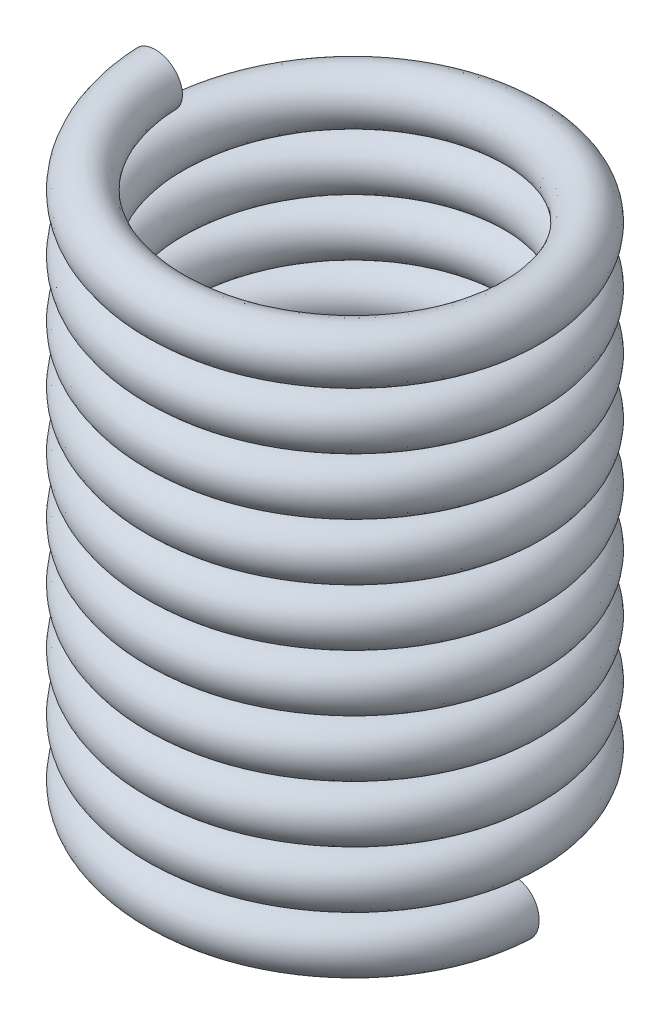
ISO-10303-21;
HEADER;
FILE_DESCRIPTION(('STEP AP214'),'2;1');
FILE_NAME('part.step','',(''),(''),'','','');
FILE_SCHEMA(('AUTOMOTIVE_DESIGN { 1 0 10303 214 1 1 1 1 }'));
ENDSEC;
DATA;
#1=APPLICATION_CONTEXT('core data for automotive mechanical design processes');
#2=APPLICATION_PROTOCOL_DEFINITION('international standard','automotive_design',2000,#1);
#3=PRODUCT_CONTEXT('',#1,'mechanical');
#4=PRODUCT('Part','Part','',(#3));
#5=PRODUCT_RELATED_PRODUCT_CATEGORY('part','',(#4));
#6=PRODUCT_DEFINITION_FORMATION('','',#4);
#7=PRODUCT_DEFINITION_CONTEXT('part definition',#1,'design');
#8=PRODUCT_DEFINITION('design','',#6,#7);
#9=PRODUCT_DEFINITION_SHAPE('','',#8);
#10=(LENGTH_UNIT() NAMED_UNIT(*) SI_UNIT(.MILLI.,.METRE.));
#11=(NAMED_UNIT(*) PLANE_ANGLE_UNIT() SI_UNIT($,.RADIAN.));
#12=(NAMED_UNIT(*) SI_UNIT($,.STERADIAN.) SOLID_ANGLE_UNIT());
#13=UNCERTAINTY_MEASURE_WITH_UNIT(LENGTH_MEASURE(1.E-05),#10,'distance_accuracy_value','');
#14=(GEOMETRIC_REPRESENTATION_CONTEXT(3) GLOBAL_UNCERTAINTY_ASSIGNED_CONTEXT((#13)) GLOBAL_UNIT_ASSIGNED_CONTEXT((#10,
#11,#12)) REPRESENTATION_CONTEXT('',''));
#15=CARTESIAN_POINT('',(0.,0.,0.));
#16=DIRECTION('',(0.,0.,1.));
#17=DIRECTION('',(1.,0.,0.));
#18=AXIS2_PLACEMENT_3D('',#15,#16,#17);
#19=CARTESIAN_POINT('',(1.143,0.,0.));
#20=DIRECTION('',(0.,0.0505669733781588,0.998720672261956));
#21=DIRECTION('',(0.,-0.998720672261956,0.0505669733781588));
#22=AXIS2_PLACEMENT_3D('',#19,#20,#21);
#23=PLANE('',#22);
#24=CARTESIAN_POINT('',(1.143,0.,0.));
#25=DIRECTION('',(0.,0.0505669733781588,0.998720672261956));
#26=DIRECTION('',(0.,-0.998720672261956,0.0505669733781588));
#27=AXIS2_PLACEMENT_3D('',#24,#25,#26);
#28=CIRCLE('',#27,0.1651);
#29=CARTESIAN_POINT('',(1.143,-0.164888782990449,0.00834860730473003));
#30=VERTEX_POINT('',#29);
#31=EDGE_CURVE('E41',#30,#30,#28,.T.);
#32=ORIENTED_EDGE('',*,*,#31,.F.);
#33=EDGE_LOOP('',(#32));
#34=FACE_BOUND('',#33,.T.);
#35=ADVANCED_FACE('F31',(#34),#23,.F.);
#36=CARTESIAN_POINT('',(-1.143,3.4544,-1.51718989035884E-13));
#37=DIRECTION('',(1.33141213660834E-13,0.0505669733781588,-0.998720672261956));
#38=DIRECTION('',(0.,-0.998720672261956,-0.0505669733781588));
#39=AXIS2_PLACEMENT_3D('',#36,#37,#38);
#40=PLANE('',#39);
#41=CARTESIAN_POINT('',(-1.143,3.4544,-1.51718989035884E-13));
#42=DIRECTION('',(1.33141213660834E-13,0.0505669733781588,-0.998720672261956));
#43=DIRECTION('',(0.,-0.998720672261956,-0.0505669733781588));
#44=AXIS2_PLACEMENT_3D('',#41,#42,#43);
#45=CIRCLE('',#44,0.1651);
#46=CARTESIAN_POINT('',(-1.143,3.28951121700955,-0.00834860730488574));
#47=VERTEX_POINT('',#46);
#48=EDGE_CURVE('E11',#47,#47,#45,.T.);
#49=ORIENTED_EDGE('',*,*,#48,.T.);
#50=EDGE_LOOP('',(#49));
#51=FACE_BOUND('',#50,.T.);
#52=ADVANCED_FACE('F48',(#51),#40,.T.);
#53=CARTESIAN_POINT('',(1.143,-0.164888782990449,0.00834860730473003));
#54=CARTESIAN_POINT('',(1.13817992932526,-0.134587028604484,0.668259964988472));
#55=CARTESIAN_POINT('',(0.564269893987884,-0.104285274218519,0.994041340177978));
#56=CARTESIAN_POINT('',(-0.00964014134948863,-0.0739835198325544,1.31982271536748));
#57=CARTESIAN_POINT('',(-0.578730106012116,-0.0436817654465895,0.985692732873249));
#58=CARTESIAN_POINT('',(-1.14782007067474,-0.0133800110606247,0.651562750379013));
#59=CARTESIAN_POINT('',(-1.143,0.0169217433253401,-0.00834860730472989));
#60=CARTESIAN_POINT('',(-1.13817992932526,0.047223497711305,-0.668259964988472));
#61=CARTESIAN_POINT('',(-0.564269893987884,0.0775252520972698,-0.994041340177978));
#62=CARTESIAN_POINT('',(0.00964014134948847,0.107827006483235,-1.31982271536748));
#63=CARTESIAN_POINT('',(0.578730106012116,0.138128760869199,-0.985692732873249));
#64=CARTESIAN_POINT('',(1.14782007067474,0.168430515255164,-0.651562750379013));
#65=CARTESIAN_POINT('',(1.143,0.198732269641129,0.00834860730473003));
#66=CARTESIAN_POINT('',(1.13817992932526,0.229034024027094,0.668259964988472));
#67=CARTESIAN_POINT('',(0.564269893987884,0.259335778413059,0.994041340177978));
#68=CARTESIAN_POINT('',(-0.00964014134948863,0.289637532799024,1.31982271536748));
#69=CARTESIAN_POINT('',(-0.578730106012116,0.319939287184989,0.985692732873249));
#70=CARTESIAN_POINT('',(-1.14782007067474,0.350241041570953,0.651562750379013));
#71=CARTESIAN_POINT('',(-1.143,0.380542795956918,-0.00834860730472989));
#72=CARTESIAN_POINT('',(-1.13817992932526,0.410844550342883,-0.668259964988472));
#73=CARTESIAN_POINT('',(-0.564269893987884,0.441146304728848,-0.994041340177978));
#74=CARTESIAN_POINT('',(0.00964014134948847,0.471448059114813,-1.31982271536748));
#75=CARTESIAN_POINT('',(0.578730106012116,0.501749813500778,-0.985692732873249));
#76=CARTESIAN_POINT('',(1.14782007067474,0.532051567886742,-0.651562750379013));
#77=CARTESIAN_POINT('',(1.143,0.562353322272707,0.00834860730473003));
#78=CARTESIAN_POINT('',(1.13817992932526,0.592655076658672,0.668259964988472));
#79=CARTESIAN_POINT('',(0.564269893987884,0.622956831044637,0.994041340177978));
#80=CARTESIAN_POINT('',(-0.00964014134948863,0.653258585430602,1.31982271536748));
#81=CARTESIAN_POINT('',(-0.578730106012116,0.683560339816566,0.985692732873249));
#82=CARTESIAN_POINT('',(-1.14782007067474,0.713862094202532,0.651562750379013));
#83=CARTESIAN_POINT('',(-1.143,0.744163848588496,-0.00834860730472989));
#84=CARTESIAN_POINT('',(-1.13817992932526,0.774465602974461,-0.668259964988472));
#85=CARTESIAN_POINT('',(-0.564269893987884,0.804767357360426,-0.994041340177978));
#86=CARTESIAN_POINT('',(0.00964014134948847,0.835069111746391,-1.31982271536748));
#87=CARTESIAN_POINT('',(0.578730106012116,0.865370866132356,-0.985692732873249));
#88=CARTESIAN_POINT('',(1.14782007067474,0.89567262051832,-0.651562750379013));
#89=CARTESIAN_POINT('',(1.143,0.925974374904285,0.00834860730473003));
#90=CARTESIAN_POINT('',(1.13817992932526,0.95627612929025,0.668259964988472));
#91=CARTESIAN_POINT('',(0.564269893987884,0.986577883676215,0.994041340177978));
#92=CARTESIAN_POINT('',(-0.00964014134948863,1.01687963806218,1.31982271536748));
#93=CARTESIAN_POINT('',(-0.578730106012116,1.04718139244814,0.985692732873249));
#94=CARTESIAN_POINT('',(-1.14782007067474,1.07748314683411,0.651562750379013));
#95=CARTESIAN_POINT('',(-1.143,1.10778490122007,-0.00834860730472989));
#96=CARTESIAN_POINT('',(-1.13817992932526,1.13808665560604,-0.668259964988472));
#97=CARTESIAN_POINT('',(-0.564269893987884,1.168388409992,-0.994041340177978));
#98=CARTESIAN_POINT('',(0.00964014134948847,1.19869016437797,-1.31982271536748));
#99=CARTESIAN_POINT('',(0.578730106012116,1.22899191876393,-0.985692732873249));
#100=CARTESIAN_POINT('',(1.14782007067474,1.2592936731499,-0.651562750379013));
#101=CARTESIAN_POINT('',(1.143,1.28959542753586,0.00834860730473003));
#102=CARTESIAN_POINT('',(1.13817992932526,1.31989718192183,0.668259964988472));
#103=CARTESIAN_POINT('',(0.564269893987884,1.35019893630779,0.994041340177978));
#104=CARTESIAN_POINT('',(-0.00964014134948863,1.38050069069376,1.31982271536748));
#105=CARTESIAN_POINT('',(-0.578730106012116,1.41080244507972,0.985692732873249));
#106=CARTESIAN_POINT('',(-1.14782007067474,1.44110419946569,0.651562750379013));
#107=CARTESIAN_POINT('',(-1.143,1.47140595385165,-0.00834860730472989));
#108=CARTESIAN_POINT('',(-1.13817992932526,1.50170770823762,-0.668259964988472));
#109=CARTESIAN_POINT('',(-0.564269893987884,1.53200946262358,-0.994041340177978));
#110=CARTESIAN_POINT('',(0.00964014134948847,1.56231121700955,-1.31982271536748));
#111=CARTESIAN_POINT('',(0.578730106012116,1.59261297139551,-0.985692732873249));
#112=CARTESIAN_POINT('',(1.14782007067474,1.62291472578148,-0.651562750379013));
#113=CARTESIAN_POINT('',(1.143,1.65321648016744,0.00834860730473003));
#114=CARTESIAN_POINT('',(1.13817992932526,1.68351823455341,0.668259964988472));
#115=CARTESIAN_POINT('',(0.564269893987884,1.71381998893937,0.994041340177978));
#116=CARTESIAN_POINT('',(-0.00964014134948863,1.74412174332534,1.31982271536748));
#117=CARTESIAN_POINT('',(-0.578730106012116,1.7744234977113,0.985692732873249));
#118=CARTESIAN_POINT('',(-1.14782007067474,1.80472525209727,0.651562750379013));
#119=CARTESIAN_POINT('',(-1.143,1.83502700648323,-0.00834860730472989));
#120=CARTESIAN_POINT('',(-1.13817992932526,1.8653287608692,-0.668259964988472));
#121=CARTESIAN_POINT('',(-0.564269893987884,1.89563051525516,-0.994041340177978));
#122=CARTESIAN_POINT('',(0.00964014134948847,1.92593226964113,-1.31982271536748));
#123=CARTESIAN_POINT('',(0.578730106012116,1.95623402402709,-0.985692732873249));
#124=CARTESIAN_POINT('',(1.14782007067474,1.98653577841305,-0.651562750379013));
#125=CARTESIAN_POINT('',(1.143,2.01683753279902,0.00834860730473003));
#126=CARTESIAN_POINT('',(1.13817992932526,2.04713928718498,0.668259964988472));
#127=CARTESIAN_POINT('',(0.564269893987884,2.07744104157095,0.994041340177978));
#128=CARTESIAN_POINT('',(-0.00964014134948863,2.10774279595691,1.31982271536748));
#129=CARTESIAN_POINT('',(-0.578730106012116,2.13804455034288,0.985692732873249));
#130=CARTESIAN_POINT('',(-1.14782007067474,2.16834630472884,0.651562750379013));
#131=CARTESIAN_POINT('',(-1.143,2.19864805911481,-0.00834860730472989));
#132=CARTESIAN_POINT('',(-1.13817992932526,2.22894981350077,-0.668259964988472));
#133=CARTESIAN_POINT('',(-0.564269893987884,2.25925156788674,-0.994041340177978));
#134=CARTESIAN_POINT('',(0.00964014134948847,2.2895533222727,-1.31982271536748));
#135=CARTESIAN_POINT('',(0.578730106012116,2.31985507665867,-0.985692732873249));
#136=CARTESIAN_POINT('',(1.14782007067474,2.35015683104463,-0.651562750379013));
#137=CARTESIAN_POINT('',(1.143,2.3804585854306,0.00834860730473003));
#138=CARTESIAN_POINT('',(1.13817992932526,2.41076033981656,0.668259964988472));
#139=CARTESIAN_POINT('',(0.564269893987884,2.44106209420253,0.994041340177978));
#140=CARTESIAN_POINT('',(-0.00964014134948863,2.47136384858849,1.31982271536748));
#141=CARTESIAN_POINT('',(-0.578730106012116,2.50166560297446,0.985692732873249));
#142=CARTESIAN_POINT('',(-1.14782007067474,2.53196735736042,0.651562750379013));
#143=CARTESIAN_POINT('',(-1.143,2.56226911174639,-0.00834860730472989));
#144=CARTESIAN_POINT('',(-1.13817992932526,2.59257086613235,-0.668259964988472));
#145=CARTESIAN_POINT('',(-0.564269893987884,2.62287262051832,-0.994041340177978));
#146=CARTESIAN_POINT('',(0.00964014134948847,2.65317437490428,-1.31982271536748));
#147=CARTESIAN_POINT('',(0.578730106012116,2.68347612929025,-0.985692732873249));
#148=CARTESIAN_POINT('',(1.14782007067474,2.71377788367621,-0.651562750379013));
#149=CARTESIAN_POINT('',(1.143,2.74407963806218,0.00834860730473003));
#150=CARTESIAN_POINT('',(1.13817992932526,2.77438139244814,0.668259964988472));
#151=CARTESIAN_POINT('',(0.564269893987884,2.80468314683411,0.994041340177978));
#152=CARTESIAN_POINT('',(-0.00964014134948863,2.83498490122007,1.31982271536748));
#153=CARTESIAN_POINT('',(-0.578730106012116,2.86528665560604,0.985692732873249));
#154=CARTESIAN_POINT('',(-1.14782007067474,2.895588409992,0.651562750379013));
#155=CARTESIAN_POINT('',(-1.143,2.92589016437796,-0.00834860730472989));
#156=CARTESIAN_POINT('',(-1.13817992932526,2.95619191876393,-0.668259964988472));
#157=CARTESIAN_POINT('',(-0.564269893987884,2.98649367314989,-0.994041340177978));
#158=CARTESIAN_POINT('',(0.00964014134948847,3.01679542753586,-1.31982271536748));
#159=CARTESIAN_POINT('',(0.578730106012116,3.04709718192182,-0.985692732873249));
#160=CARTESIAN_POINT('',(1.14782007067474,3.07739893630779,-0.651562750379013));
#161=CARTESIAN_POINT('',(1.143,3.10770069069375,0.00834860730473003));
#162=CARTESIAN_POINT('',(1.13817992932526,3.13800244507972,0.668259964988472));
#163=CARTESIAN_POINT('',(0.564269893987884,3.16830419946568,0.994041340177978));
#164=CARTESIAN_POINT('',(-0.00964014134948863,3.19860595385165,1.31982271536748));
#165=CARTESIAN_POINT('',(-0.578730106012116,3.22890770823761,0.985692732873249));
#166=CARTESIAN_POINT('',(-1.14782007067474,3.25920946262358,0.651562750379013));
#167=CARTESIAN_POINT('',(-1.143,3.28951121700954,-0.00834860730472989));
#168=CARTESIAN_POINT('',(-1.13817992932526,3.31981297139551,-0.668259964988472));
#169=CARTESIAN_POINT('',(-0.564269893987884,3.35011472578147,-0.994041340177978));
#170=CARTESIAN_POINT('',(0.00964014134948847,3.38041648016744,-1.31982271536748));
#171=CARTESIAN_POINT('',(0.578730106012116,3.4107182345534,-0.985692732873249));
#172=CARTESIAN_POINT('',(1.14782007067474,3.44101998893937,-0.651562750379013));
#173=CARTESIAN_POINT('',(1.143,3.47132174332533,0.00834860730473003));
#174=CARTESIAN_POINT('',(1.4732,-0.164888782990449,0.00834860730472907));
#175=CARTESIAN_POINT('',(1.46837992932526,-0.134587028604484,0.858901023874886));
#176=CARTESIAN_POINT('',(0.729369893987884,-0.104285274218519,1.2800029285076));
#177=CARTESIAN_POINT('',(-0.0096401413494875,-0.0739835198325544,1.70110483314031));
#178=CARTESIAN_POINT('',(-0.743830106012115,-0.0436817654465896,1.27165432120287));
#179=CARTESIAN_POINT('',(-1.47802007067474,-0.0133800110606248,0.842203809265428));
#180=CARTESIAN_POINT('',(-1.4732,0.0169217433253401,-0.00834860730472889));
#181=CARTESIAN_POINT('',(-1.46837992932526,0.0472234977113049,-0.858901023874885));
#182=CARTESIAN_POINT('',(-0.729369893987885,0.0775252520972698,-1.2800029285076));
#183=CARTESIAN_POINT('',(0.00964014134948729,0.107827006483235,-1.70110483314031));
#184=CARTESIAN_POINT('',(0.743830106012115,0.138128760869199,-1.27165432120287));
#185=CARTESIAN_POINT('',(1.47802007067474,0.168430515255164,-0.842203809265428));
#186=CARTESIAN_POINT('',(1.4732,0.198732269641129,0.00834860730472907));
#187=CARTESIAN_POINT('',(1.46837992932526,0.229034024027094,0.858901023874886));
#188=CARTESIAN_POINT('',(0.729369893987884,0.259335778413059,1.2800029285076));
#189=CARTESIAN_POINT('',(-0.0096401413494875,0.289637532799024,1.70110483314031));
#190=CARTESIAN_POINT('',(-0.743830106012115,0.319939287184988,1.27165432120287));
#191=CARTESIAN_POINT('',(-1.47802007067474,0.350241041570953,0.842203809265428));
#192=CARTESIAN_POINT('',(-1.4732,0.380542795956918,-0.00834860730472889));
#193=CARTESIAN_POINT('',(-1.46837992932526,0.410844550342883,-0.858901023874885));
#194=CARTESIAN_POINT('',(-0.729369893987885,0.441146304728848,-1.2800029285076));
#195=CARTESIAN_POINT('',(0.00964014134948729,0.471448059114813,-1.70110483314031));
#196=CARTESIAN_POINT('',(0.743830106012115,0.501749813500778,-1.27165432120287));
#197=CARTESIAN_POINT('',(1.47802007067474,0.532051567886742,-0.842203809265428));
#198=CARTESIAN_POINT('',(1.4732,0.562353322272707,0.00834860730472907));
#199=CARTESIAN_POINT('',(1.46837992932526,0.592655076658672,0.858901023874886));
#200=CARTESIAN_POINT('',(0.729369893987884,0.622956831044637,1.2800029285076));
#201=CARTESIAN_POINT('',(-0.0096401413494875,0.653258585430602,1.70110483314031));
#202=CARTESIAN_POINT('',(-0.743830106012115,0.683560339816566,1.27165432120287));
#203=CARTESIAN_POINT('',(-1.47802007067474,0.713862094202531,0.842203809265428));
#204=CARTESIAN_POINT('',(-1.4732,0.744163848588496,-0.00834860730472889));
#205=CARTESIAN_POINT('',(-1.46837992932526,0.774465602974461,-0.858901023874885));
#206=CARTESIAN_POINT('',(-0.729369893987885,0.804767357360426,-1.2800029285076));
#207=CARTESIAN_POINT('',(0.00964014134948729,0.835069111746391,-1.70110483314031));
#208=CARTESIAN_POINT('',(0.743830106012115,0.865370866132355,-1.27165432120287));
#209=CARTESIAN_POINT('',(1.47802007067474,0.89567262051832,-0.842203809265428));
#210=CARTESIAN_POINT('',(1.4732,0.925974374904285,0.00834860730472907));
#211=CARTESIAN_POINT('',(1.46837992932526,0.95627612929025,0.858901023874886));
#212=CARTESIAN_POINT('',(0.729369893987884,0.986577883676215,1.2800029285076));
#213=CARTESIAN_POINT('',(-0.0096401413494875,1.01687963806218,1.70110483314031));
#214=CARTESIAN_POINT('',(-0.743830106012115,1.04718139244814,1.27165432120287));
#215=CARTESIAN_POINT('',(-1.47802007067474,1.07748314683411,0.842203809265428));
#216=CARTESIAN_POINT('',(-1.4732,1.10778490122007,-0.00834860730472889));
#217=CARTESIAN_POINT('',(-1.46837992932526,1.13808665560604,-0.858901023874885));
#218=CARTESIAN_POINT('',(-0.729369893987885,1.168388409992,-1.2800029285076));
#219=CARTESIAN_POINT('',(0.00964014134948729,1.19869016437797,-1.70110483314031));
#220=CARTESIAN_POINT('',(0.743830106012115,1.22899191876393,-1.27165432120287));
#221=CARTESIAN_POINT('',(1.47802007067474,1.2592936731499,-0.842203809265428));
#222=CARTESIAN_POINT('',(1.4732,1.28959542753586,0.00834860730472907));
#223=CARTESIAN_POINT('',(1.46837992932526,1.31989718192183,0.858901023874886));
#224=CARTESIAN_POINT('',(0.729369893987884,1.35019893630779,1.2800029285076));
#225=CARTESIAN_POINT('',(-0.0096401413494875,1.38050069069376,1.70110483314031));
#226=CARTESIAN_POINT('',(-0.743830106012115,1.41080244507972,1.27165432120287));
#227=CARTESIAN_POINT('',(-1.47802007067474,1.44110419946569,0.842203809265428));
#228=CARTESIAN_POINT('',(-1.4732,1.47140595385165,-0.00834860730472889));
#229=CARTESIAN_POINT('',(-1.46837992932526,1.50170770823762,-0.858901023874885));
#230=CARTESIAN_POINT('',(-0.729369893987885,1.53200946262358,-1.2800029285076));
#231=CARTESIAN_POINT('',(0.00964014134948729,1.56231121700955,-1.70110483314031));
#232=CARTESIAN_POINT('',(0.743830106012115,1.59261297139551,-1.27165432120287));
#233=CARTESIAN_POINT('',(1.47802007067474,1.62291472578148,-0.842203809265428));
#234=CARTESIAN_POINT('',(1.4732,1.65321648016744,0.00834860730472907));
#235=CARTESIAN_POINT('',(1.46837992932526,1.68351823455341,0.858901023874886));
#236=CARTESIAN_POINT('',(0.729369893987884,1.71381998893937,1.2800029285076));
#237=CARTESIAN_POINT('',(-0.0096401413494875,1.74412174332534,1.70110483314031));
#238=CARTESIAN_POINT('',(-0.743830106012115,1.7744234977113,1.27165432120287));
#239=CARTESIAN_POINT('',(-1.47802007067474,1.80472525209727,0.842203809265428));
#240=CARTESIAN_POINT('',(-1.4732,1.83502700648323,-0.00834860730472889));
#241=CARTESIAN_POINT('',(-1.46837992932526,1.8653287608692,-0.858901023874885));
#242=CARTESIAN_POINT('',(-0.729369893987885,1.89563051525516,-1.2800029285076));
#243=CARTESIAN_POINT('',(0.00964014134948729,1.92593226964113,-1.70110483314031));
#244=CARTESIAN_POINT('',(0.743830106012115,1.95623402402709,-1.27165432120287));
#245=CARTESIAN_POINT('',(1.47802007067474,1.98653577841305,-0.842203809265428));
#246=CARTESIAN_POINT('',(1.4732,2.01683753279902,0.00834860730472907));
#247=CARTESIAN_POINT('',(1.46837992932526,2.04713928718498,0.858901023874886));
#248=CARTESIAN_POINT('',(0.729369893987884,2.07744104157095,1.2800029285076));
#249=CARTESIAN_POINT('',(-0.0096401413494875,2.10774279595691,1.70110483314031));
#250=CARTESIAN_POINT('',(-0.743830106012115,2.13804455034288,1.27165432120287));
#251=CARTESIAN_POINT('',(-1.47802007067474,2.16834630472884,0.842203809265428));
#252=CARTESIAN_POINT('',(-1.4732,2.19864805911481,-0.00834860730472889));
#253=CARTESIAN_POINT('',(-1.46837992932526,2.22894981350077,-0.858901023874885));
#254=CARTESIAN_POINT('',(-0.729369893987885,2.25925156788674,-1.2800029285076));
#255=CARTESIAN_POINT('',(0.00964014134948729,2.2895533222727,-1.70110483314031));
#256=CARTESIAN_POINT('',(0.743830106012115,2.31985507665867,-1.27165432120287));
#257=CARTESIAN_POINT('',(1.47802007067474,2.35015683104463,-0.842203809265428));
#258=CARTESIAN_POINT('',(1.4732,2.3804585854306,0.00834860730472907));
#259=CARTESIAN_POINT('',(1.46837992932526,2.41076033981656,0.858901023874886));
#260=CARTESIAN_POINT('',(0.729369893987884,2.44106209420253,1.2800029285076));
#261=CARTESIAN_POINT('',(-0.0096401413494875,2.47136384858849,1.70110483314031));
#262=CARTESIAN_POINT('',(-0.743830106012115,2.50166560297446,1.27165432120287));
#263=CARTESIAN_POINT('',(-1.47802007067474,2.53196735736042,0.842203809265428));
#264=CARTESIAN_POINT('',(-1.4732,2.56226911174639,-0.00834860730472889));
#265=CARTESIAN_POINT('',(-1.46837992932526,2.59257086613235,-0.858901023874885));
#266=CARTESIAN_POINT('',(-0.729369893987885,2.62287262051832,-1.2800029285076));
#267=CARTESIAN_POINT('',(0.00964014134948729,2.65317437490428,-1.70110483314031));
#268=CARTESIAN_POINT('',(0.743830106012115,2.68347612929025,-1.27165432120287));
#269=CARTESIAN_POINT('',(1.47802007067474,2.71377788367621,-0.842203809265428));
#270=CARTESIAN_POINT('',(1.4732,2.74407963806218,0.00834860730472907));
#271=CARTESIAN_POINT('',(1.46837992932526,2.77438139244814,0.858901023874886));
#272=CARTESIAN_POINT('',(0.729369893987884,2.80468314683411,1.2800029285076));
#273=CARTESIAN_POINT('',(-0.0096401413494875,2.83498490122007,1.70110483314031));
#274=CARTESIAN_POINT('',(-0.743830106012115,2.86528665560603,1.27165432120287));
#275=CARTESIAN_POINT('',(-1.47802007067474,2.895588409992,0.842203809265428));
#276=CARTESIAN_POINT('',(-1.4732,2.92589016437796,-0.00834860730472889));
#277=CARTESIAN_POINT('',(-1.46837992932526,2.95619191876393,-0.858901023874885));
#278=CARTESIAN_POINT('',(-0.729369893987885,2.98649367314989,-1.2800029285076));
#279=CARTESIAN_POINT('',(0.00964014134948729,3.01679542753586,-1.70110483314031));
#280=CARTESIAN_POINT('',(0.743830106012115,3.04709718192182,-1.27165432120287));
#281=CARTESIAN_POINT('',(1.47802007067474,3.07739893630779,-0.842203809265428));
#282=CARTESIAN_POINT('',(1.4732,3.10770069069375,0.00834860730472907));
#283=CARTESIAN_POINT('',(1.46837992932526,3.13800244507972,0.858901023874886));
#284=CARTESIAN_POINT('',(0.729369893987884,3.16830419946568,1.2800029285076));
#285=CARTESIAN_POINT('',(-0.0096401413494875,3.19860595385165,1.70110483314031));
#286=CARTESIAN_POINT('',(-0.743830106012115,3.22890770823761,1.27165432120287));
#287=CARTESIAN_POINT('',(-1.47802007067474,3.25920946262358,0.842203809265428));
#288=CARTESIAN_POINT('',(-1.4732,3.28951121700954,-0.00834860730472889));
#289=CARTESIAN_POINT('',(-1.46837992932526,3.31981297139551,-0.858901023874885));
#290=CARTESIAN_POINT('',(-0.729369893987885,3.35011472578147,-1.2800029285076));
#291=CARTESIAN_POINT('',(0.00964014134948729,3.38041648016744,-1.70110483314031));
#292=CARTESIAN_POINT('',(0.743830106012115,3.4107182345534,-1.27165432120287));
#293=CARTESIAN_POINT('',(1.47802007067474,3.44101998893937,-0.842203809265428));
#294=CARTESIAN_POINT('',(1.4732,3.47132174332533,0.00834860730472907));
#295=CARTESIAN_POINT('',(1.4732,0.164888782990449,-0.00834860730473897));
#296=CARTESIAN_POINT('',(1.47802007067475,0.195190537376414,0.842203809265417));
#297=CARTESIAN_POINT('',(0.743830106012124,0.225492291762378,1.27165432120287));
#298=CARTESIAN_POINT('',(0.00964014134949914,0.255794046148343,1.70110483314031));
#299=CARTESIAN_POINT('',(-0.729369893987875,0.286095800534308,1.2800029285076));
#300=CARTESIAN_POINT('',(-1.46837992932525,0.316397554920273,0.858901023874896));
#301=CARTESIAN_POINT('',(-1.4732,0.346699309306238,0.00834860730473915));
#302=CARTESIAN_POINT('',(-1.47802007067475,0.377001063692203,-0.842203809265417));
#303=CARTESIAN_POINT('',(-0.743830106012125,0.407302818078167,-1.27165432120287));
#304=CARTESIAN_POINT('',(-0.00964014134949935,0.437604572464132,-1.70110483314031));
#305=CARTESIAN_POINT('',(0.729369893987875,0.467906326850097,-1.28000292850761));
#306=CARTESIAN_POINT('',(1.46837992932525,0.498208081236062,-0.858901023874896));
#307=CARTESIAN_POINT('',(1.4732,0.528509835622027,-0.00834860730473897));
#308=CARTESIAN_POINT('',(1.47802007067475,0.558811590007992,0.842203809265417));
#309=CARTESIAN_POINT('',(0.743830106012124,0.589113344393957,1.27165432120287));
#310=CARTESIAN_POINT('',(0.00964014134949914,0.619415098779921,1.70110483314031));
#311=CARTESIAN_POINT('',(-0.729369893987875,0.649716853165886,1.2800029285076));
#312=CARTESIAN_POINT('',(-1.46837992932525,0.680018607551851,0.858901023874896));
#313=CARTESIAN_POINT('',(-1.4732,0.710320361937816,0.00834860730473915));
#314=CARTESIAN_POINT('',(-1.47802007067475,0.740622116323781,-0.842203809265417));
#315=CARTESIAN_POINT('',(-0.743830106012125,0.770923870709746,-1.27165432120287));
#316=CARTESIAN_POINT('',(-0.00964014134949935,0.801225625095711,-1.70110483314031));
#317=CARTESIAN_POINT('',(0.729369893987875,0.831527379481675,-1.28000292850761));
#318=CARTESIAN_POINT('',(1.46837992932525,0.86182913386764,-0.858901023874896));
#319=CARTESIAN_POINT('',(1.4732,0.892130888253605,-0.00834860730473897));
#320=CARTESIAN_POINT('',(1.47802007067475,0.92243264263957,0.842203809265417));
#321=CARTESIAN_POINT('',(0.743830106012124,0.952734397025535,1.27165432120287));
#322=CARTESIAN_POINT('',(0.00964014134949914,0.983036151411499,1.70110483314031));
#323=CARTESIAN_POINT('',(-0.729369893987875,1.01333790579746,1.2800029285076));
#324=CARTESIAN_POINT('',(-1.46837992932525,1.04363966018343,0.858901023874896));
#325=CARTESIAN_POINT('',(-1.4732,1.07394141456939,0.00834860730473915));
#326=CARTESIAN_POINT('',(-1.47802007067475,1.10424316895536,-0.842203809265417));
#327=CARTESIAN_POINT('',(-0.743830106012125,1.13454492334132,-1.27165432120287));
#328=CARTESIAN_POINT('',(-0.00964014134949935,1.16484667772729,-1.70110483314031));
#329=CARTESIAN_POINT('',(0.729369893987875,1.19514843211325,-1.28000292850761));
#330=CARTESIAN_POINT('',(1.46837992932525,1.22545018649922,-0.858901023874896));
#331=CARTESIAN_POINT('',(1.4732,1.25575194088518,-0.00834860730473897));
#332=CARTESIAN_POINT('',(1.47802007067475,1.28605369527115,0.842203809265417));
#333=CARTESIAN_POINT('',(0.743830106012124,1.31635544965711,1.27165432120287));
#334=CARTESIAN_POINT('',(0.00964014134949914,1.34665720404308,1.70110483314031));
#335=CARTESIAN_POINT('',(-0.729369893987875,1.37695895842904,1.2800029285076));
#336=CARTESIAN_POINT('',(-1.46837992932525,1.40726071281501,0.858901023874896));
#337=CARTESIAN_POINT('',(-1.4732,1.43756246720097,0.00834860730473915));
#338=CARTESIAN_POINT('',(-1.47802007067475,1.46786422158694,-0.842203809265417));
#339=CARTESIAN_POINT('',(-0.743830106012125,1.4981659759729,-1.27165432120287));
#340=CARTESIAN_POINT('',(-0.00964014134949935,1.52846773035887,-1.70110483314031));
#341=CARTESIAN_POINT('',(0.729369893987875,1.55876948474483,-1.28000292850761));
#342=CARTESIAN_POINT('',(1.46837992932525,1.5890712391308,-0.858901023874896));
#343=CARTESIAN_POINT('',(1.4732,1.61937299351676,-0.00834860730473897));
#344=CARTESIAN_POINT('',(1.47802007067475,1.64967474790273,0.842203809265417));
#345=CARTESIAN_POINT('',(0.743830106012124,1.67997650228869,1.27165432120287));
#346=CARTESIAN_POINT('',(0.00964014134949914,1.71027825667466,1.70110483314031));
#347=CARTESIAN_POINT('',(-0.729369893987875,1.74058001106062,1.2800029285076));
#348=CARTESIAN_POINT('',(-1.46837992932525,1.77088176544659,0.858901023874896));
#349=CARTESIAN_POINT('',(-1.4732,1.80118351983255,0.00834860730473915));
#350=CARTESIAN_POINT('',(-1.47802007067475,1.83148527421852,-0.842203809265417));
#351=CARTESIAN_POINT('',(-0.743830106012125,1.86178702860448,-1.27165432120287));
#352=CARTESIAN_POINT('',(-0.00964014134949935,1.89208878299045,-1.70110483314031));
#353=CARTESIAN_POINT('',(0.729369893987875,1.92239053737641,-1.28000292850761));
#354=CARTESIAN_POINT('',(1.46837992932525,1.95269229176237,-0.858901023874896));
#355=CARTESIAN_POINT('',(1.4732,1.98299404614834,-0.00834860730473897));
#356=CARTESIAN_POINT('',(1.47802007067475,2.0132958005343,0.842203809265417));
#357=CARTESIAN_POINT('',(0.743830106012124,2.04359755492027,1.27165432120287));
#358=CARTESIAN_POINT('',(0.00964014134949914,2.07389930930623,1.70110483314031));
#359=CARTESIAN_POINT('',(-0.729369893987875,2.1042010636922,1.2800029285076));
#360=CARTESIAN_POINT('',(-1.46837992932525,2.13450281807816,0.858901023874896));
#361=CARTESIAN_POINT('',(-1.4732,2.16480457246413,0.00834860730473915));
#362=CARTESIAN_POINT('',(-1.47802007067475,2.19510632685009,-0.842203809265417));
#363=CARTESIAN_POINT('',(-0.743830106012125,2.22540808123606,-1.27165432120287));
#364=CARTESIAN_POINT('',(-0.00964014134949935,2.25570983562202,-1.70110483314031));
#365=CARTESIAN_POINT('',(0.729369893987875,2.28601159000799,-1.28000292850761));
#366=CARTESIAN_POINT('',(1.46837992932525,2.31631334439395,-0.858901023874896));
#367=CARTESIAN_POINT('',(1.4732,2.34661509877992,-0.00834860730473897));
#368=CARTESIAN_POINT('',(1.47802007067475,2.37691685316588,0.842203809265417));
#369=CARTESIAN_POINT('',(0.743830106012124,2.40721860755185,1.27165432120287));
#370=CARTESIAN_POINT('',(0.00964014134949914,2.43752036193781,1.70110483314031));
#371=CARTESIAN_POINT('',(-0.729369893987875,2.46782211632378,1.2800029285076));
#372=CARTESIAN_POINT('',(-1.46837992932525,2.49812387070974,0.858901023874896));
#373=CARTESIAN_POINT('',(-1.4732,2.52842562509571,0.00834860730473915));
#374=CARTESIAN_POINT('',(-1.47802007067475,2.55872737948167,-0.842203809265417));
#375=CARTESIAN_POINT('',(-0.743830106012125,2.58902913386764,-1.27165432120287));
#376=CARTESIAN_POINT('',(-0.00964014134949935,2.6193308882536,-1.70110483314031));
#377=CARTESIAN_POINT('',(0.729369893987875,2.64963264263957,-1.28000292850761));
#378=CARTESIAN_POINT('',(1.46837992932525,2.67993439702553,-0.858901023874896));
#379=CARTESIAN_POINT('',(1.4732,2.7102361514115,-0.00834860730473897));
#380=CARTESIAN_POINT('',(1.47802007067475,2.74053790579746,0.842203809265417));
#381=CARTESIAN_POINT('',(0.743830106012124,2.77083966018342,1.27165432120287));
#382=CARTESIAN_POINT('',(0.00964014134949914,2.80114141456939,1.70110483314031));
#383=CARTESIAN_POINT('',(-0.729369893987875,2.83144316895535,1.2800029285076));
#384=CARTESIAN_POINT('',(-1.46837992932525,2.86174492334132,0.858901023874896));
#385=CARTESIAN_POINT('',(-1.4732,2.89204667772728,0.00834860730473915));
#386=CARTESIAN_POINT('',(-1.47802007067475,2.92234843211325,-0.842203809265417));
#387=CARTESIAN_POINT('',(-0.743830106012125,2.95265018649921,-1.27165432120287));
#388=CARTESIAN_POINT('',(-0.00964014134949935,2.98295194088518,-1.70110483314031));
#389=CARTESIAN_POINT('',(0.729369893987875,3.01325369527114,-1.28000292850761));
#390=CARTESIAN_POINT('',(1.46837992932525,3.04355544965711,-0.858901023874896));
#391=CARTESIAN_POINT('',(1.4732,3.07385720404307,-0.00834860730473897));
#392=CARTESIAN_POINT('',(1.47802007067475,3.10415895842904,0.842203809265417));
#393=CARTESIAN_POINT('',(0.743830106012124,3.134460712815,1.27165432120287));
#394=CARTESIAN_POINT('',(0.00964014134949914,3.16476246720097,1.70110483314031));
#395=CARTESIAN_POINT('',(-0.729369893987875,3.19506422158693,1.2800029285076));
#396=CARTESIAN_POINT('',(-1.46837992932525,3.2253659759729,0.858901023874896));
#397=CARTESIAN_POINT('',(-1.4732,3.25566773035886,0.00834860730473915));
#398=CARTESIAN_POINT('',(-1.47802007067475,3.28596948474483,-0.842203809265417));
#399=CARTESIAN_POINT('',(-0.743830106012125,3.31627123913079,-1.27165432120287));
#400=CARTESIAN_POINT('',(-0.00964014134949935,3.34657299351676,-1.70110483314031));
#401=CARTESIAN_POINT('',(0.729369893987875,3.37687474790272,-1.28000292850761));
#402=CARTESIAN_POINT('',(1.46837992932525,3.40717650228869,-0.858901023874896));
#403=CARTESIAN_POINT('',(1.4732,3.43747825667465,-0.00834860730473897));
#404=CARTESIAN_POINT('',(1.47802007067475,3.46778001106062,0.842203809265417));
#405=CARTESIAN_POINT('',(0.743830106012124,3.49808176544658,1.27165432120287));
#406=CARTESIAN_POINT('',(0.00964014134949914,3.52838351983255,1.70110483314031));
#407=CARTESIAN_POINT('',(-0.729369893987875,3.55868527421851,1.2800029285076));
#408=CARTESIAN_POINT('',(-1.46837992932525,3.58898702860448,0.858901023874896));
#409=CARTESIAN_POINT('',(-1.4732,3.61928878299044,0.00834860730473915));
#410=CARTESIAN_POINT('',(-1.47802007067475,3.64959053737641,-0.842203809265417));
#411=CARTESIAN_POINT('',(-0.743830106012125,3.67989229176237,-1.27165432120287));
#412=CARTESIAN_POINT('',(-0.00964014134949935,3.71019404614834,-1.70110483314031));
#413=CARTESIAN_POINT('',(0.729369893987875,3.7404958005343,-1.28000292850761));
#414=CARTESIAN_POINT('',(1.46837992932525,3.77079755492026,-0.858901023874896));
#415=CARTESIAN_POINT('',(1.4732,3.80109930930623,-0.00834860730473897));
#416=CARTESIAN_POINT('',(1.143,0.164888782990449,-0.00834860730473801));
#417=CARTESIAN_POINT('',(1.14782007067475,0.195190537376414,0.651562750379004));
#418=CARTESIAN_POINT('',(0.578730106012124,0.225492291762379,0.985692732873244));
#419=CARTESIAN_POINT('',(0.00964014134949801,0.255794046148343,1.31982271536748));
#420=CARTESIAN_POINT('',(-0.564269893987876,0.286095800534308,0.994041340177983));
#421=CARTESIAN_POINT('',(-1.13817992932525,0.316397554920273,0.668259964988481));
#422=CARTESIAN_POINT('',(-1.143,0.346699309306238,0.00834860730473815));
#423=CARTESIAN_POINT('',(-1.14782007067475,0.377001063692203,-0.651562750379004));
#424=CARTESIAN_POINT('',(-0.578730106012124,0.407302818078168,-0.985692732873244));
#425=CARTESIAN_POINT('',(-0.00964014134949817,0.437604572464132,-1.31982271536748));
#426=CARTESIAN_POINT('',(0.564269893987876,0.467906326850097,-0.994041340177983));
#427=CARTESIAN_POINT('',(1.13817992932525,0.498208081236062,-0.668259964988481));
#428=CARTESIAN_POINT('',(1.143,0.528509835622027,-0.00834860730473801));
#429=CARTESIAN_POINT('',(1.14782007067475,0.558811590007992,0.651562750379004));
#430=CARTESIAN_POINT('',(0.578730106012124,0.589113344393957,0.985692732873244));
#431=CARTESIAN_POINT('',(0.00964014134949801,0.619415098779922,1.31982271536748));
#432=CARTESIAN_POINT('',(-0.564269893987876,0.649716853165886,0.994041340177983));
#433=CARTESIAN_POINT('',(-1.13817992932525,0.680018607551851,0.668259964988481));
#434=CARTESIAN_POINT('',(-1.143,0.710320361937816,0.00834860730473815));
#435=CARTESIAN_POINT('',(-1.14782007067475,0.740622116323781,-0.651562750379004));
#436=CARTESIAN_POINT('',(-0.578730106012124,0.770923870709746,-0.985692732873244));
#437=CARTESIAN_POINT('',(-0.00964014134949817,0.80122562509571,-1.31982271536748));
#438=CARTESIAN_POINT('',(0.564269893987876,0.831527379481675,-0.994041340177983));
#439=CARTESIAN_POINT('',(1.13817992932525,0.86182913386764,-0.668259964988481));
#440=CARTESIAN_POINT('',(1.143,0.892130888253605,-0.00834860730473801));
#441=CARTESIAN_POINT('',(1.14782007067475,0.92243264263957,0.651562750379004));
#442=CARTESIAN_POINT('',(0.578730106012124,0.952734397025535,0.985692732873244));
#443=CARTESIAN_POINT('',(0.00964014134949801,0.983036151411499,1.31982271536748));
#444=CARTESIAN_POINT('',(-0.564269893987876,1.01333790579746,0.994041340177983));
#445=CARTESIAN_POINT('',(-1.13817992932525,1.04363966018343,0.668259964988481));
#446=CARTESIAN_POINT('',(-1.143,1.07394141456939,0.00834860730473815));
#447=CARTESIAN_POINT('',(-1.14782007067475,1.10424316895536,-0.651562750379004));
#448=CARTESIAN_POINT('',(-0.578730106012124,1.13454492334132,-0.985692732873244));
#449=CARTESIAN_POINT('',(-0.00964014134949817,1.16484667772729,-1.31982271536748));
#450=CARTESIAN_POINT('',(0.564269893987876,1.19514843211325,-0.994041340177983));
#451=CARTESIAN_POINT('',(1.13817992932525,1.22545018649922,-0.668259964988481));
#452=CARTESIAN_POINT('',(1.143,1.25575194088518,-0.00834860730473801));
#453=CARTESIAN_POINT('',(1.14782007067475,1.28605369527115,0.651562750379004));
#454=CARTESIAN_POINT('',(0.578730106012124,1.31635544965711,0.985692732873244));
#455=CARTESIAN_POINT('',(0.00964014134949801,1.34665720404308,1.31982271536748));
#456=CARTESIAN_POINT('',(-0.564269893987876,1.37695895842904,0.994041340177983));
#457=CARTESIAN_POINT('',(-1.13817992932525,1.40726071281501,0.668259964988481));
#458=CARTESIAN_POINT('',(-1.143,1.43756246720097,0.00834860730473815));
#459=CARTESIAN_POINT('',(-1.14782007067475,1.46786422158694,-0.651562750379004));
#460=CARTESIAN_POINT('',(-0.578730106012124,1.4981659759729,-0.985692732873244));
#461=CARTESIAN_POINT('',(-0.00964014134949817,1.52846773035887,-1.31982271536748));
#462=CARTESIAN_POINT('',(0.564269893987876,1.55876948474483,-0.994041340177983));
#463=CARTESIAN_POINT('',(1.13817992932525,1.5890712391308,-0.668259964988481));
#464=CARTESIAN_POINT('',(1.143,1.61937299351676,-0.00834860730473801));
#465=CARTESIAN_POINT('',(1.14782007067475,1.64967474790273,0.651562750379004));
#466=CARTESIAN_POINT('',(0.578730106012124,1.67997650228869,0.985692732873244));
#467=CARTESIAN_POINT('',(0.00964014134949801,1.71027825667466,1.31982271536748));
#468=CARTESIAN_POINT('',(-0.564269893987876,1.74058001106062,0.994041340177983));
#469=CARTESIAN_POINT('',(-1.13817992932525,1.77088176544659,0.668259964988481));
#470=CARTESIAN_POINT('',(-1.143,1.80118351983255,0.00834860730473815));
#471=CARTESIAN_POINT('',(-1.14782007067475,1.83148527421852,-0.651562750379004));
#472=CARTESIAN_POINT('',(-0.578730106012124,1.86178702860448,-0.985692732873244));
#473=CARTESIAN_POINT('',(-0.00964014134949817,1.89208878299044,-1.31982271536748));
#474=CARTESIAN_POINT('',(0.564269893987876,1.92239053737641,-0.994041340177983));
#475=CARTESIAN_POINT('',(1.13817992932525,1.95269229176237,-0.668259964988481));
#476=CARTESIAN_POINT('',(1.143,1.98299404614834,-0.00834860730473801));
#477=CARTESIAN_POINT('',(1.14782007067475,2.0132958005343,0.651562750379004));
#478=CARTESIAN_POINT('',(0.578730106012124,2.04359755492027,0.985692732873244));
#479=CARTESIAN_POINT('',(0.00964014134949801,2.07389930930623,1.31982271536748));
#480=CARTESIAN_POINT('',(-0.564269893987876,2.1042010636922,0.994041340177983));
#481=CARTESIAN_POINT('',(-1.13817992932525,2.13450281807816,0.668259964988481));
#482=CARTESIAN_POINT('',(-1.143,2.16480457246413,0.00834860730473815));
#483=CARTESIAN_POINT('',(-1.14782007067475,2.19510632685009,-0.651562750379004));
#484=CARTESIAN_POINT('',(-0.578730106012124,2.22540808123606,-0.985692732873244));
#485=CARTESIAN_POINT('',(-0.00964014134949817,2.25570983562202,-1.31982271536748));
#486=CARTESIAN_POINT('',(0.564269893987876,2.28601159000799,-0.994041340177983));
#487=CARTESIAN_POINT('',(1.13817992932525,2.31631334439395,-0.668259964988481));
#488=CARTESIAN_POINT('',(1.143,2.34661509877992,-0.00834860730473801));
#489=CARTESIAN_POINT('',(1.14782007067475,2.37691685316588,0.651562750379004));
#490=CARTESIAN_POINT('',(0.578730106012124,2.40721860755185,0.985692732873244));
#491=CARTESIAN_POINT('',(0.00964014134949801,2.43752036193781,1.31982271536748));
#492=CARTESIAN_POINT('',(-0.564269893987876,2.46782211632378,0.994041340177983));
#493=CARTESIAN_POINT('',(-1.13817992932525,2.49812387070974,0.668259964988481));
#494=CARTESIAN_POINT('',(-1.143,2.52842562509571,0.00834860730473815));
#495=CARTESIAN_POINT('',(-1.14782007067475,2.55872737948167,-0.651562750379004));
#496=CARTESIAN_POINT('',(-0.578730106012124,2.58902913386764,-0.985692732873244));
#497=CARTESIAN_POINT('',(-0.00964014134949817,2.6193308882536,-1.31982271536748));
#498=CARTESIAN_POINT('',(0.564269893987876,2.64963264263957,-0.994041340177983));
#499=CARTESIAN_POINT('',(1.13817992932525,2.67993439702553,-0.668259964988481));
#500=CARTESIAN_POINT('',(1.143,2.7102361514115,-0.00834860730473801));
#501=CARTESIAN_POINT('',(1.14782007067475,2.74053790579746,0.651562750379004));
#502=CARTESIAN_POINT('',(0.578730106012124,2.77083966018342,0.985692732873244));
#503=CARTESIAN_POINT('',(0.00964014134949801,2.80114141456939,1.31982271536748));
#504=CARTESIAN_POINT('',(-0.564269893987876,2.83144316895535,0.994041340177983));
#505=CARTESIAN_POINT('',(-1.13817992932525,2.86174492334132,0.668259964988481));
#506=CARTESIAN_POINT('',(-1.143,2.89204667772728,0.00834860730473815));
#507=CARTESIAN_POINT('',(-1.14782007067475,2.92234843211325,-0.651562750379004));
#508=CARTESIAN_POINT('',(-0.578730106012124,2.95265018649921,-0.985692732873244));
#509=CARTESIAN_POINT('',(-0.00964014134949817,2.98295194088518,-1.31982271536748));
#510=CARTESIAN_POINT('',(0.564269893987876,3.01325369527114,-0.994041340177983));
#511=CARTESIAN_POINT('',(1.13817992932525,3.04355544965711,-0.668259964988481));
#512=CARTESIAN_POINT('',(1.143,3.07385720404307,-0.00834860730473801));
#513=CARTESIAN_POINT('',(1.14782007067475,3.10415895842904,0.651562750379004));
#514=CARTESIAN_POINT('',(0.578730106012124,3.134460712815,0.985692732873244));
#515=CARTESIAN_POINT('',(0.00964014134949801,3.16476246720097,1.31982271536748));
#516=CARTESIAN_POINT('',(-0.564269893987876,3.19506422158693,0.994041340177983));
#517=CARTESIAN_POINT('',(-1.13817992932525,3.2253659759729,0.668259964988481));
#518=CARTESIAN_POINT('',(-1.143,3.25566773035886,0.00834860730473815));
#519=CARTESIAN_POINT('',(-1.14782007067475,3.28596948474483,-0.651562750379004));
#520=CARTESIAN_POINT('',(-0.578730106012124,3.31627123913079,-0.985692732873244));
#521=CARTESIAN_POINT('',(-0.00964014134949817,3.34657299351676,-1.31982271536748));
#522=CARTESIAN_POINT('',(0.564269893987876,3.37687474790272,-0.994041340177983));
#523=CARTESIAN_POINT('',(1.13817992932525,3.40717650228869,-0.668259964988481));
#524=CARTESIAN_POINT('',(1.143,3.43747825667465,-0.00834860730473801));
#525=CARTESIAN_POINT('',(1.14782007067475,3.46778001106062,0.651562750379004));
#526=CARTESIAN_POINT('',(0.578730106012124,3.49808176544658,0.985692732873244));
#527=CARTESIAN_POINT('',(0.00964014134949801,3.52838351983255,1.31982271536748));
#528=CARTESIAN_POINT('',(-0.564269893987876,3.55868527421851,0.994041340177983));
#529=CARTESIAN_POINT('',(-1.13817992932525,3.58898702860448,0.668259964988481));
#530=CARTESIAN_POINT('',(-1.143,3.61928878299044,0.00834860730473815));
#531=CARTESIAN_POINT('',(-1.14782007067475,3.64959053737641,-0.651562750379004));
#532=CARTESIAN_POINT('',(-0.578730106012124,3.67989229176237,-0.985692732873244));
#533=CARTESIAN_POINT('',(-0.00964014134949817,3.71019404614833,-1.31982271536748));
#534=CARTESIAN_POINT('',(0.564269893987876,3.7404958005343,-0.994041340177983));
#535=CARTESIAN_POINT('',(1.13817992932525,3.77079755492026,-0.668259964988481));
#536=CARTESIAN_POINT('',(1.143,3.80109930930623,-0.00834860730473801));
#537=CARTESIAN_POINT('',(0.8128,0.164888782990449,-0.00834860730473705));
#538=CARTESIAN_POINT('',(0.817620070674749,0.195190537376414,0.460921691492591));
#539=CARTESIAN_POINT('',(0.413630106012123,0.225492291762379,0.699731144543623));
#540=CARTESIAN_POINT('',(0.00964014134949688,0.255794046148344,0.938540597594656));
#541=CARTESIAN_POINT('',(-0.399169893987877,0.286095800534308,0.70807975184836));
#542=CARTESIAN_POINT('',(-0.807979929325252,0.316397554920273,0.477618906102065));
#543=CARTESIAN_POINT('',(-0.8128,0.346699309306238,0.00834860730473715));
#544=CARTESIAN_POINT('',(-0.817620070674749,0.377001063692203,-0.460921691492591));
#545=CARTESIAN_POINT('',(-0.413630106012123,0.407302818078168,-0.699731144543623));
#546=CARTESIAN_POINT('',(-0.009640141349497,0.437604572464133,-0.938540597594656));
#547=CARTESIAN_POINT('',(0.399169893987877,0.467906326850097,-0.708079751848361));
#548=CARTESIAN_POINT('',(0.807979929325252,0.498208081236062,-0.477618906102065));
#549=CARTESIAN_POINT('',(0.8128,0.528509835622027,-0.00834860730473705));
#550=CARTESIAN_POINT('',(0.817620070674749,0.558811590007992,0.460921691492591));
#551=CARTESIAN_POINT('',(0.413630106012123,0.589113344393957,0.699731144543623));
#552=CARTESIAN_POINT('',(0.00964014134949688,0.619415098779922,0.938540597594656));
#553=CARTESIAN_POINT('',(-0.399169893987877,0.649716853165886,0.70807975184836));
#554=CARTESIAN_POINT('',(-0.807979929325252,0.680018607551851,0.477618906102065));
#555=CARTESIAN_POINT('',(-0.8128,0.710320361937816,0.00834860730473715));
#556=CARTESIAN_POINT('',(-0.817620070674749,0.740622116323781,-0.460921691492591));
#557=CARTESIAN_POINT('',(-0.413630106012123,0.770923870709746,-0.699731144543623));
#558=CARTESIAN_POINT('',(-0.009640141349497,0.801225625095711,-0.938540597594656));
#559=CARTESIAN_POINT('',(0.399169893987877,0.831527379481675,-0.708079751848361));
#560=CARTESIAN_POINT('',(0.807979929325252,0.86182913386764,-0.477618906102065));
#561=CARTESIAN_POINT('',(0.8128,0.892130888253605,-0.00834860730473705));
#562=CARTESIAN_POINT('',(0.817620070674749,0.92243264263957,0.460921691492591));
#563=CARTESIAN_POINT('',(0.413630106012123,0.952734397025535,0.699731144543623));
#564=CARTESIAN_POINT('',(0.00964014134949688,0.9830361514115,0.938540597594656));
#565=CARTESIAN_POINT('',(-0.399169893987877,1.01333790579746,0.70807975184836));
#566=CARTESIAN_POINT('',(-0.807979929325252,1.04363966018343,0.477618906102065));
#567=CARTESIAN_POINT('',(-0.8128,1.07394141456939,0.00834860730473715));
#568=CARTESIAN_POINT('',(-0.817620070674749,1.10424316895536,-0.460921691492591));
#569=CARTESIAN_POINT('',(-0.413630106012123,1.13454492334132,-0.699731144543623));
#570=CARTESIAN_POINT('',(-0.009640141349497,1.16484667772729,-0.938540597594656));
#571=CARTESIAN_POINT('',(0.399169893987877,1.19514843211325,-0.708079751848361));
#572=CARTESIAN_POINT('',(0.807979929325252,1.22545018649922,-0.477618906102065));
#573=CARTESIAN_POINT('',(0.8128,1.25575194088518,-0.00834860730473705));
#574=CARTESIAN_POINT('',(0.817620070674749,1.28605369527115,0.460921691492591));
#575=CARTESIAN_POINT('',(0.413630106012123,1.31635544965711,0.699731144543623));
#576=CARTESIAN_POINT('',(0.00964014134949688,1.34665720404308,0.938540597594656));
#577=CARTESIAN_POINT('',(-0.399169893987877,1.37695895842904,0.70807975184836));
#578=CARTESIAN_POINT('',(-0.807979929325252,1.40726071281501,0.477618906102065));
#579=CARTESIAN_POINT('',(-0.8128,1.43756246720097,0.00834860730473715));
#580=CARTESIAN_POINT('',(-0.817620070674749,1.46786422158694,-0.460921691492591));
#581=CARTESIAN_POINT('',(-0.413630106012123,1.4981659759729,-0.699731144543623));
#582=CARTESIAN_POINT('',(-0.009640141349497,1.52846773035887,-0.938540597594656));
#583=CARTESIAN_POINT('',(0.399169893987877,1.55876948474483,-0.708079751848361));
#584=CARTESIAN_POINT('',(0.807979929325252,1.5890712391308,-0.477618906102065));
#585=CARTESIAN_POINT('',(0.8128,1.61937299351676,-0.00834860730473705));
#586=CARTESIAN_POINT('',(0.817620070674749,1.64967474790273,0.460921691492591));
#587=CARTESIAN_POINT('',(0.413630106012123,1.67997650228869,0.699731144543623));
#588=CARTESIAN_POINT('',(0.00964014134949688,1.71027825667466,0.938540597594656));
#589=CARTESIAN_POINT('',(-0.399169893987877,1.74058001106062,0.70807975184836));
#590=CARTESIAN_POINT('',(-0.807979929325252,1.77088176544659,0.477618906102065));
#591=CARTESIAN_POINT('',(-0.8128,1.80118351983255,0.00834860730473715));
#592=CARTESIAN_POINT('',(-0.817620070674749,1.83148527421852,-0.460921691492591));
#593=CARTESIAN_POINT('',(-0.413630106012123,1.86178702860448,-0.699731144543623));
#594=CARTESIAN_POINT('',(-0.009640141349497,1.89208878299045,-0.938540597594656));
#595=CARTESIAN_POINT('',(0.399169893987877,1.92239053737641,-0.708079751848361));
#596=CARTESIAN_POINT('',(0.807979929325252,1.95269229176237,-0.477618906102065));
#597=CARTESIAN_POINT('',(0.8128,1.98299404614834,-0.00834860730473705));
#598=CARTESIAN_POINT('',(0.817620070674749,2.0132958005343,0.460921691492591));
#599=CARTESIAN_POINT('',(0.413630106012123,2.04359755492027,0.699731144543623));
#600=CARTESIAN_POINT('',(0.00964014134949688,2.07389930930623,0.938540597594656));
#601=CARTESIAN_POINT('',(-0.399169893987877,2.1042010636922,0.70807975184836));
#602=CARTESIAN_POINT('',(-0.807979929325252,2.13450281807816,0.477618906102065));
#603=CARTESIAN_POINT('',(-0.8128,2.16480457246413,0.00834860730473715));
#604=CARTESIAN_POINT('',(-0.817620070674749,2.19510632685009,-0.460921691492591));
#605=CARTESIAN_POINT('',(-0.413630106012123,2.22540808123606,-0.699731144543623));
#606=CARTESIAN_POINT('',(-0.009640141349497,2.25570983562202,-0.938540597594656));
#607=CARTESIAN_POINT('',(0.399169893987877,2.28601159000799,-0.708079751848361));
#608=CARTESIAN_POINT('',(0.807979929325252,2.31631334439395,-0.477618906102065));
#609=CARTESIAN_POINT('',(0.8128,2.34661509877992,-0.00834860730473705));
#610=CARTESIAN_POINT('',(0.817620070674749,2.37691685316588,0.460921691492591));
#611=CARTESIAN_POINT('',(0.413630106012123,2.40721860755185,0.699731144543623));
#612=CARTESIAN_POINT('',(0.00964014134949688,2.43752036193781,0.938540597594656));
#613=CARTESIAN_POINT('',(-0.399169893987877,2.46782211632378,0.70807975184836));
#614=CARTESIAN_POINT('',(-0.807979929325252,2.49812387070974,0.477618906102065));
#615=CARTESIAN_POINT('',(-0.8128,2.52842562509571,0.00834860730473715));
#616=CARTESIAN_POINT('',(-0.817620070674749,2.55872737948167,-0.460921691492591));
#617=CARTESIAN_POINT('',(-0.413630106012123,2.58902913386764,-0.699731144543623));
#618=CARTESIAN_POINT('',(-0.009640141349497,2.6193308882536,-0.938540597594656));
#619=CARTESIAN_POINT('',(0.399169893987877,2.64963264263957,-0.708079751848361));
#620=CARTESIAN_POINT('',(0.807979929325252,2.67993439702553,-0.477618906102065));
#621=CARTESIAN_POINT('',(0.8128,2.7102361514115,-0.00834860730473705));
#622=CARTESIAN_POINT('',(0.817620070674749,2.74053790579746,0.460921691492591));
#623=CARTESIAN_POINT('',(0.413630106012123,2.77083966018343,0.699731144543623));
#624=CARTESIAN_POINT('',(0.00964014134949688,2.80114141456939,0.938540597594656));
#625=CARTESIAN_POINT('',(-0.399169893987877,2.83144316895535,0.70807975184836));
#626=CARTESIAN_POINT('',(-0.807979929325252,2.86174492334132,0.477618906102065));
#627=CARTESIAN_POINT('',(-0.8128,2.89204667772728,0.00834860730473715));
#628=CARTESIAN_POINT('',(-0.817620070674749,2.92234843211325,-0.460921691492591));
#629=CARTESIAN_POINT('',(-0.413630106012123,2.95265018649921,-0.699731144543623));
#630=CARTESIAN_POINT('',(-0.009640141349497,2.98295194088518,-0.938540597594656));
#631=CARTESIAN_POINT('',(0.399169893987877,3.01325369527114,-0.708079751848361));
#632=CARTESIAN_POINT('',(0.807979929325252,3.04355544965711,-0.477618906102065));
#633=CARTESIAN_POINT('',(0.8128,3.07385720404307,-0.00834860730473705));
#634=CARTESIAN_POINT('',(0.817620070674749,3.10415895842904,0.460921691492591));
#635=CARTESIAN_POINT('',(0.413630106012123,3.134460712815,0.699731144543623));
#636=CARTESIAN_POINT('',(0.00964014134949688,3.16476246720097,0.938540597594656));
#637=CARTESIAN_POINT('',(-0.399169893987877,3.19506422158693,0.70807975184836));
#638=CARTESIAN_POINT('',(-0.807979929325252,3.2253659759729,0.477618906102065));
#639=CARTESIAN_POINT('',(-0.8128,3.25566773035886,0.00834860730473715));
#640=CARTESIAN_POINT('',(-0.817620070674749,3.28596948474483,-0.460921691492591));
#641=CARTESIAN_POINT('',(-0.413630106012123,3.31627123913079,-0.699731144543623));
#642=CARTESIAN_POINT('',(-0.009640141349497,3.34657299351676,-0.938540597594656));
#643=CARTESIAN_POINT('',(0.399169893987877,3.37687474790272,-0.708079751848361));
#644=CARTESIAN_POINT('',(0.807979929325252,3.40717650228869,-0.477618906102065));
#645=CARTESIAN_POINT('',(0.8128,3.43747825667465,-0.00834860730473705));
#646=CARTESIAN_POINT('',(0.817620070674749,3.46778001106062,0.460921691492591));
#647=CARTESIAN_POINT('',(0.413630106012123,3.49808176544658,0.699731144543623));
#648=CARTESIAN_POINT('',(0.00964014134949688,3.52838351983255,0.938540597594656));
#649=CARTESIAN_POINT('',(-0.399169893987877,3.55868527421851,0.70807975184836));
#650=CARTESIAN_POINT('',(-0.807979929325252,3.58898702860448,0.477618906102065));
#651=CARTESIAN_POINT('',(-0.8128,3.61928878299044,0.00834860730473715));
#652=CARTESIAN_POINT('',(-0.817620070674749,3.64959053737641,-0.460921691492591));
#653=CARTESIAN_POINT('',(-0.413630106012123,3.67989229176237,-0.699731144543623));
#654=CARTESIAN_POINT('',(-0.009640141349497,3.71019404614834,-0.938540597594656));
#655=CARTESIAN_POINT('',(0.399169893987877,3.7404958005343,-0.708079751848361));
#656=CARTESIAN_POINT('',(0.807979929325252,3.77079755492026,-0.477618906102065));
#657=CARTESIAN_POINT('',(0.8128,3.80109930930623,-0.00834860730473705));
#658=CARTESIAN_POINT('',(0.8128,-0.164888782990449,0.00834860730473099));
#659=CARTESIAN_POINT('',(0.807979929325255,-0.134587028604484,0.477618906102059));
#660=CARTESIAN_POINT('',(0.399169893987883,-0.104285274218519,0.708079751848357));
#661=CARTESIAN_POINT('',(-0.00964014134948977,-0.0739835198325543,0.938540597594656));
#662=CARTESIAN_POINT('',(-0.413630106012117,-0.0436817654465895,0.699731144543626));
#663=CARTESIAN_POINT('',(-0.817620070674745,-0.0133800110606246,0.460921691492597));
#664=CARTESIAN_POINT('',(-0.8128,0.0169217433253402,-0.00834860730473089));
#665=CARTESIAN_POINT('',(-0.807979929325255,0.0472234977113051,-0.477618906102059));
#666=CARTESIAN_POINT('',(-0.399169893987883,0.0775252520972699,-0.708079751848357));
#667=CARTESIAN_POINT('',(0.00964014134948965,0.107827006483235,-0.938540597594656));
#668=CARTESIAN_POINT('',(0.413630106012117,0.1381287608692,-0.699731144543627));
#669=CARTESIAN_POINT('',(0.817620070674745,0.168430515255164,-0.460921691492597));
#670=CARTESIAN_POINT('',(0.8128,0.198732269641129,0.00834860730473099));
#671=CARTESIAN_POINT('',(0.807979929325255,0.229034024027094,0.477618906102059));
#672=CARTESIAN_POINT('',(0.399169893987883,0.259335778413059,0.708079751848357));
#673=CARTESIAN_POINT('',(-0.00964014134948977,0.289637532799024,0.938540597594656));
#674=CARTESIAN_POINT('',(-0.413630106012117,0.319939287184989,0.699731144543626));
#675=CARTESIAN_POINT('',(-0.817620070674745,0.350241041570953,0.460921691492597));
#676=CARTESIAN_POINT('',(-0.8128,0.380542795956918,-0.00834860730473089));
#677=CARTESIAN_POINT('',(-0.807979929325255,0.410844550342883,-0.477618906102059));
#678=CARTESIAN_POINT('',(-0.399169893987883,0.441146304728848,-0.708079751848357));
#679=CARTESIAN_POINT('',(0.00964014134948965,0.471448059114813,-0.938540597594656));
#680=CARTESIAN_POINT('',(0.413630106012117,0.501749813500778,-0.699731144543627));
#681=CARTESIAN_POINT('',(0.817620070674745,0.532051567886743,-0.460921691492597));
#682=CARTESIAN_POINT('',(0.8128,0.562353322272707,0.00834860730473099));
#683=CARTESIAN_POINT('',(0.807979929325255,0.592655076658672,0.477618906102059));
#684=CARTESIAN_POINT('',(0.399169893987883,0.622956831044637,0.708079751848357));
#685=CARTESIAN_POINT('',(-0.00964014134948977,0.653258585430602,0.938540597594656));
#686=CARTESIAN_POINT('',(-0.413630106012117,0.683560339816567,0.699731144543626));
#687=CARTESIAN_POINT('',(-0.817620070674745,0.713862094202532,0.460921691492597));
#688=CARTESIAN_POINT('',(-0.8128,0.744163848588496,-0.00834860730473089));
#689=CARTESIAN_POINT('',(-0.807979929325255,0.774465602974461,-0.477618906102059));
#690=CARTESIAN_POINT('',(-0.399169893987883,0.804767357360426,-0.708079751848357));
#691=CARTESIAN_POINT('',(0.00964014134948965,0.835069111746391,-0.938540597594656));
#692=CARTESIAN_POINT('',(0.413630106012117,0.865370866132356,-0.699731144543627));
#693=CARTESIAN_POINT('',(0.817620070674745,0.895672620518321,-0.460921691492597));
#694=CARTESIAN_POINT('',(0.8128,0.925974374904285,0.00834860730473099));
#695=CARTESIAN_POINT('',(0.807979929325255,0.95627612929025,0.477618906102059));
#696=CARTESIAN_POINT('',(0.399169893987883,0.986577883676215,0.708079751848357));
#697=CARTESIAN_POINT('',(-0.00964014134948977,1.01687963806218,0.938540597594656));
#698=CARTESIAN_POINT('',(-0.413630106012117,1.04718139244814,0.699731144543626));
#699=CARTESIAN_POINT('',(-0.817620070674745,1.07748314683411,0.460921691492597));
#700=CARTESIAN_POINT('',(-0.8128,1.10778490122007,-0.00834860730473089));
#701=CARTESIAN_POINT('',(-0.807979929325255,1.13808665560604,-0.477618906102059));
#702=CARTESIAN_POINT('',(-0.399169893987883,1.168388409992,-0.708079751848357));
#703=CARTESIAN_POINT('',(0.00964014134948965,1.19869016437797,-0.938540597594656));
#704=CARTESIAN_POINT('',(0.413630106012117,1.22899191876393,-0.699731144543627));
#705=CARTESIAN_POINT('',(0.817620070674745,1.2592936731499,-0.460921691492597));
#706=CARTESIAN_POINT('',(0.8128,1.28959542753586,0.00834860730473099));
#707=CARTESIAN_POINT('',(0.807979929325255,1.31989718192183,0.477618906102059));
#708=CARTESIAN_POINT('',(0.399169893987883,1.35019893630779,0.708079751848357));
#709=CARTESIAN_POINT('',(-0.00964014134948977,1.38050069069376,0.938540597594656));
#710=CARTESIAN_POINT('',(-0.413630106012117,1.41080244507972,0.699731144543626));
#711=CARTESIAN_POINT('',(-0.817620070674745,1.44110419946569,0.460921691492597));
#712=CARTESIAN_POINT('',(-0.8128,1.47140595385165,-0.00834860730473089));
#713=CARTESIAN_POINT('',(-0.807979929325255,1.50170770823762,-0.477618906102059));
#714=CARTESIAN_POINT('',(-0.399169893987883,1.53200946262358,-0.708079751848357));
#715=CARTESIAN_POINT('',(0.00964014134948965,1.56231121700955,-0.938540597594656));
#716=CARTESIAN_POINT('',(0.413630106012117,1.59261297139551,-0.699731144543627));
#717=CARTESIAN_POINT('',(0.817620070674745,1.62291472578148,-0.460921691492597));
#718=CARTESIAN_POINT('',(0.8128,1.65321648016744,0.00834860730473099));
#719=CARTESIAN_POINT('',(0.807979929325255,1.68351823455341,0.477618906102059));
#720=CARTESIAN_POINT('',(0.399169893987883,1.71381998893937,0.708079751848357));
#721=CARTESIAN_POINT('',(-0.00964014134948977,1.74412174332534,0.938540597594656));
#722=CARTESIAN_POINT('',(-0.413630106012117,1.7744234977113,0.699731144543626));
#723=CARTESIAN_POINT('',(-0.817620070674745,1.80472525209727,0.460921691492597));
#724=CARTESIAN_POINT('',(-0.8128,1.83502700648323,-0.00834860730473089));
#725=CARTESIAN_POINT('',(-0.807979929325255,1.8653287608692,-0.477618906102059));
#726=CARTESIAN_POINT('',(-0.399169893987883,1.89563051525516,-0.708079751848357));
#727=CARTESIAN_POINT('',(0.00964014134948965,1.92593226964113,-0.938540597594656));
#728=CARTESIAN_POINT('',(0.413630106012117,1.95623402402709,-0.699731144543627));
#729=CARTESIAN_POINT('',(0.817620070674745,1.98653577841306,-0.460921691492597));
#730=CARTESIAN_POINT('',(0.8128,2.01683753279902,0.00834860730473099));
#731=CARTESIAN_POINT('',(0.807979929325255,2.04713928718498,0.477618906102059));
#732=CARTESIAN_POINT('',(0.399169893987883,2.07744104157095,0.708079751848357));
#733=CARTESIAN_POINT('',(-0.00964014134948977,2.10774279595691,0.938540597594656));
#734=CARTESIAN_POINT('',(-0.413630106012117,2.13804455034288,0.699731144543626));
#735=CARTESIAN_POINT('',(-0.817620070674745,2.16834630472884,0.460921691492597));
#736=CARTESIAN_POINT('',(-0.8128,2.19864805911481,-0.00834860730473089));
#737=CARTESIAN_POINT('',(-0.807979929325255,2.22894981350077,-0.477618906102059));
#738=CARTESIAN_POINT('',(-0.399169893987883,2.25925156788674,-0.708079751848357));
#739=CARTESIAN_POINT('',(0.00964014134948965,2.2895533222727,-0.938540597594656));
#740=CARTESIAN_POINT('',(0.413630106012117,2.31985507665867,-0.699731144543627));
#741=CARTESIAN_POINT('',(0.817620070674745,2.35015683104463,-0.460921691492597));
#742=CARTESIAN_POINT('',(0.8128,2.3804585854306,0.00834860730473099));
#743=CARTESIAN_POINT('',(0.807979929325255,2.41076033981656,0.477618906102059));
#744=CARTESIAN_POINT('',(0.399169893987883,2.44106209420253,0.708079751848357));
#745=CARTESIAN_POINT('',(-0.00964014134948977,2.47136384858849,0.938540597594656));
#746=CARTESIAN_POINT('',(-0.413630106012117,2.50166560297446,0.699731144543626));
#747=CARTESIAN_POINT('',(-0.817620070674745,2.53196735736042,0.460921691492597));
#748=CARTESIAN_POINT('',(-0.8128,2.56226911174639,-0.00834860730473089));
#749=CARTESIAN_POINT('',(-0.807979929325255,2.59257086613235,-0.477618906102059));
#750=CARTESIAN_POINT('',(-0.399169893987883,2.62287262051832,-0.708079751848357));
#751=CARTESIAN_POINT('',(0.00964014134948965,2.65317437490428,-0.938540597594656));
#752=CARTESIAN_POINT('',(0.413630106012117,2.68347612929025,-0.699731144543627));
#753=CARTESIAN_POINT('',(0.817620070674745,2.71377788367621,-0.460921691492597));
#754=CARTESIAN_POINT('',(0.8128,2.74407963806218,0.00834860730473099));
#755=CARTESIAN_POINT('',(0.807979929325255,2.77438139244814,0.477618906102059));
#756=CARTESIAN_POINT('',(0.399169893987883,2.80468314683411,0.708079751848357));
#757=CARTESIAN_POINT('',(-0.00964014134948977,2.83498490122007,0.938540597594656));
#758=CARTESIAN_POINT('',(-0.413630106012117,2.86528665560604,0.699731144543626));
#759=CARTESIAN_POINT('',(-0.817620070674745,2.895588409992,0.460921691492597));
#760=CARTESIAN_POINT('',(-0.8128,2.92589016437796,-0.00834860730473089));
#761=CARTESIAN_POINT('',(-0.807979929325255,2.95619191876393,-0.477618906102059));
#762=CARTESIAN_POINT('',(-0.399169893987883,2.98649367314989,-0.708079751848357));
#763=CARTESIAN_POINT('',(0.00964014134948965,3.01679542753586,-0.938540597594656));
#764=CARTESIAN_POINT('',(0.413630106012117,3.04709718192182,-0.699731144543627));
#765=CARTESIAN_POINT('',(0.817620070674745,3.07739893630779,-0.460921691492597));
#766=CARTESIAN_POINT('',(0.8128,3.10770069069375,0.00834860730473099));
#767=CARTESIAN_POINT('',(0.807979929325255,3.13800244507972,0.477618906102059));
#768=CARTESIAN_POINT('',(0.399169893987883,3.16830419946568,0.708079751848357));
#769=CARTESIAN_POINT('',(-0.00964014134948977,3.19860595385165,0.938540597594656));
#770=CARTESIAN_POINT('',(-0.413630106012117,3.22890770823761,0.699731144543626));
#771=CARTESIAN_POINT('',(-0.817620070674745,3.25920946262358,0.460921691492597));
#772=CARTESIAN_POINT('',(-0.8128,3.28951121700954,-0.00834860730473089));
#773=CARTESIAN_POINT('',(-0.807979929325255,3.31981297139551,-0.477618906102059));
#774=CARTESIAN_POINT('',(-0.399169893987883,3.35011472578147,-0.708079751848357));
#775=CARTESIAN_POINT('',(0.00964014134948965,3.38041648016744,-0.938540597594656));
#776=CARTESIAN_POINT('',(0.413630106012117,3.4107182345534,-0.699731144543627));
#777=CARTESIAN_POINT('',(0.817620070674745,3.44101998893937,-0.460921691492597));
#778=CARTESIAN_POINT('',(0.8128,3.47132174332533,0.00834860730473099));
#779=CARTESIAN_POINT('',(1.143,-0.164888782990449,0.00834860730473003));
#780=CARTESIAN_POINT('',(1.13817992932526,-0.134587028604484,0.668259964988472));
#781=CARTESIAN_POINT('',(0.564269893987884,-0.104285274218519,0.994041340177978));
#782=CARTESIAN_POINT('',(-0.00964014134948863,-0.0739835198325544,1.31982271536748));
#783=CARTESIAN_POINT('',(-0.578730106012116,-0.0436817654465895,0.985692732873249));
#784=CARTESIAN_POINT('',(-1.14782007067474,-0.0133800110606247,0.651562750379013));
#785=CARTESIAN_POINT('',(-1.143,0.0169217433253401,-0.00834860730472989));
#786=CARTESIAN_POINT('',(-1.13817992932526,0.047223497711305,-0.668259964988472));
#787=CARTESIAN_POINT('',(-0.564269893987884,0.0775252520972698,-0.994041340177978));
#788=CARTESIAN_POINT('',(0.00964014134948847,0.107827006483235,-1.31982271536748));
#789=CARTESIAN_POINT('',(0.578730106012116,0.138128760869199,-0.985692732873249));
#790=CARTESIAN_POINT('',(1.14782007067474,0.168430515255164,-0.651562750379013));
#791=CARTESIAN_POINT('',(1.143,0.198732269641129,0.00834860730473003));
#792=CARTESIAN_POINT('',(1.13817992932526,0.229034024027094,0.668259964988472));
#793=CARTESIAN_POINT('',(0.564269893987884,0.259335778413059,0.994041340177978));
#794=CARTESIAN_POINT('',(-0.00964014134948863,0.289637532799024,1.31982271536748));
#795=CARTESIAN_POINT('',(-0.578730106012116,0.319939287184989,0.985692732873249));
#796=CARTESIAN_POINT('',(-1.14782007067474,0.350241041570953,0.651562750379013));
#797=CARTESIAN_POINT('',(-1.143,0.380542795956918,-0.00834860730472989));
#798=CARTESIAN_POINT('',(-1.13817992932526,0.410844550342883,-0.668259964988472));
#799=CARTESIAN_POINT('',(-0.564269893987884,0.441146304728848,-0.994041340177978));
#800=CARTESIAN_POINT('',(0.00964014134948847,0.471448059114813,-1.31982271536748));
#801=CARTESIAN_POINT('',(0.578730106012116,0.501749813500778,-0.985692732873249));
#802=CARTESIAN_POINT('',(1.14782007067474,0.532051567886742,-0.651562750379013));
#803=CARTESIAN_POINT('',(1.143,0.562353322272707,0.00834860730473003));
#804=CARTESIAN_POINT('',(1.13817992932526,0.592655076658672,0.668259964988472));
#805=CARTESIAN_POINT('',(0.564269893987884,0.622956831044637,0.994041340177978));
#806=CARTESIAN_POINT('',(-0.00964014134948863,0.653258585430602,1.31982271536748));
#807=CARTESIAN_POINT('',(-0.578730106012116,0.683560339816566,0.985692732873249));
#808=CARTESIAN_POINT('',(-1.14782007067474,0.713862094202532,0.651562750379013));
#809=CARTESIAN_POINT('',(-1.143,0.744163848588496,-0.00834860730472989));
#810=CARTESIAN_POINT('',(-1.13817992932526,0.774465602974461,-0.668259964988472));
#811=CARTESIAN_POINT('',(-0.564269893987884,0.804767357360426,-0.994041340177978));
#812=CARTESIAN_POINT('',(0.00964014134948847,0.835069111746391,-1.31982271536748));
#813=CARTESIAN_POINT('',(0.578730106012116,0.865370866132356,-0.985692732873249));
#814=CARTESIAN_POINT('',(1.14782007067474,0.89567262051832,-0.651562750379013));
#815=CARTESIAN_POINT('',(1.143,0.925974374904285,0.00834860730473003));
#816=CARTESIAN_POINT('',(1.13817992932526,0.95627612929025,0.668259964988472));
#817=CARTESIAN_POINT('',(0.564269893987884,0.986577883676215,0.994041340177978));
#818=CARTESIAN_POINT('',(-0.00964014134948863,1.01687963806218,1.31982271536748));
#819=CARTESIAN_POINT('',(-0.578730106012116,1.04718139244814,0.985692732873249));
#820=CARTESIAN_POINT('',(-1.14782007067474,1.07748314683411,0.651562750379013));
#821=CARTESIAN_POINT('',(-1.143,1.10778490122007,-0.00834860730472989));
#822=CARTESIAN_POINT('',(-1.13817992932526,1.13808665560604,-0.668259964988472));
#823=CARTESIAN_POINT('',(-0.564269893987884,1.168388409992,-0.994041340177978));
#824=CARTESIAN_POINT('',(0.00964014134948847,1.19869016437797,-1.31982271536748));
#825=CARTESIAN_POINT('',(0.578730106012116,1.22899191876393,-0.985692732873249));
#826=CARTESIAN_POINT('',(1.14782007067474,1.2592936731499,-0.651562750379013));
#827=CARTESIAN_POINT('',(1.143,1.28959542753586,0.00834860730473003));
#828=CARTESIAN_POINT('',(1.13817992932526,1.31989718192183,0.668259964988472));
#829=CARTESIAN_POINT('',(0.564269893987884,1.35019893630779,0.994041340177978));
#830=CARTESIAN_POINT('',(-0.00964014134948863,1.38050069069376,1.31982271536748));
#831=CARTESIAN_POINT('',(-0.578730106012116,1.41080244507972,0.985692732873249));
#832=CARTESIAN_POINT('',(-1.14782007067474,1.44110419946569,0.651562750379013));
#833=CARTESIAN_POINT('',(-1.143,1.47140595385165,-0.00834860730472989));
#834=CARTESIAN_POINT('',(-1.13817992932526,1.50170770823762,-0.668259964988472));
#835=CARTESIAN_POINT('',(-0.564269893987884,1.53200946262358,-0.994041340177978));
#836=CARTESIAN_POINT('',(0.00964014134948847,1.56231121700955,-1.31982271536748));
#837=CARTESIAN_POINT('',(0.578730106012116,1.59261297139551,-0.985692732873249));
#838=CARTESIAN_POINT('',(1.14782007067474,1.62291472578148,-0.651562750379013));
#839=CARTESIAN_POINT('',(1.143,1.65321648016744,0.00834860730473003));
#840=CARTESIAN_POINT('',(1.13817992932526,1.68351823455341,0.668259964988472));
#841=CARTESIAN_POINT('',(0.564269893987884,1.71381998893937,0.994041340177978));
#842=CARTESIAN_POINT('',(-0.00964014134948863,1.74412174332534,1.31982271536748));
#843=CARTESIAN_POINT('',(-0.578730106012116,1.7744234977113,0.985692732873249));
#844=CARTESIAN_POINT('',(-1.14782007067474,1.80472525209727,0.651562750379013));
#845=CARTESIAN_POINT('',(-1.143,1.83502700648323,-0.00834860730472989));
#846=CARTESIAN_POINT('',(-1.13817992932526,1.8653287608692,-0.668259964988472));
#847=CARTESIAN_POINT('',(-0.564269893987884,1.89563051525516,-0.994041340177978));
#848=CARTESIAN_POINT('',(0.00964014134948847,1.92593226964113,-1.31982271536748));
#849=CARTESIAN_POINT('',(0.578730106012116,1.95623402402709,-0.985692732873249));
#850=CARTESIAN_POINT('',(1.14782007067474,1.98653577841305,-0.651562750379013));
#851=CARTESIAN_POINT('',(1.143,2.01683753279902,0.00834860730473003));
#852=CARTESIAN_POINT('',(1.13817992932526,2.04713928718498,0.668259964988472));
#853=CARTESIAN_POINT('',(0.564269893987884,2.07744104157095,0.994041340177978));
#854=CARTESIAN_POINT('',(-0.00964014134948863,2.10774279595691,1.31982271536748));
#855=CARTESIAN_POINT('',(-0.578730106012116,2.13804455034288,0.985692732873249));
#856=CARTESIAN_POINT('',(-1.14782007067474,2.16834630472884,0.651562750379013));
#857=CARTESIAN_POINT('',(-1.143,2.19864805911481,-0.00834860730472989));
#858=CARTESIAN_POINT('',(-1.13817992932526,2.22894981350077,-0.668259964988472));
#859=CARTESIAN_POINT('',(-0.564269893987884,2.25925156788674,-0.994041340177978));
#860=CARTESIAN_POINT('',(0.00964014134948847,2.2895533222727,-1.31982271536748));
#861=CARTESIAN_POINT('',(0.578730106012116,2.31985507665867,-0.985692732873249));
#862=CARTESIAN_POINT('',(1.14782007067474,2.35015683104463,-0.651562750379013));
#863=CARTESIAN_POINT('',(1.143,2.3804585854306,0.00834860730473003));
#864=CARTESIAN_POINT('',(1.13817992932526,2.41076033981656,0.668259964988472));
#865=CARTESIAN_POINT('',(0.564269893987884,2.44106209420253,0.994041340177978));
#866=CARTESIAN_POINT('',(-0.00964014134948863,2.47136384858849,1.31982271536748));
#867=CARTESIAN_POINT('',(-0.578730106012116,2.50166560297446,0.985692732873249));
#868=CARTESIAN_POINT('',(-1.14782007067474,2.53196735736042,0.651562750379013));
#869=CARTESIAN_POINT('',(-1.143,2.56226911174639,-0.00834860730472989));
#870=CARTESIAN_POINT('',(-1.13817992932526,2.59257086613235,-0.668259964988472));
#871=CARTESIAN_POINT('',(-0.564269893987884,2.62287262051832,-0.994041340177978));
#872=CARTESIAN_POINT('',(0.00964014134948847,2.65317437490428,-1.31982271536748));
#873=CARTESIAN_POINT('',(0.578730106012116,2.68347612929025,-0.985692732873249));
#874=CARTESIAN_POINT('',(1.14782007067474,2.71377788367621,-0.651562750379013));
#875=CARTESIAN_POINT('',(1.143,2.74407963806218,0.00834860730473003));
#876=CARTESIAN_POINT('',(1.13817992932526,2.77438139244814,0.668259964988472));
#877=CARTESIAN_POINT('',(0.564269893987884,2.80468314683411,0.994041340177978));
#878=CARTESIAN_POINT('',(-0.00964014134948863,2.83498490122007,1.31982271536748));
#879=CARTESIAN_POINT('',(-0.578730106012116,2.86528665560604,0.985692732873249));
#880=CARTESIAN_POINT('',(-1.14782007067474,2.895588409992,0.651562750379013));
#881=CARTESIAN_POINT('',(-1.143,2.92589016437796,-0.00834860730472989));
#882=CARTESIAN_POINT('',(-1.13817992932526,2.95619191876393,-0.668259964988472));
#883=CARTESIAN_POINT('',(-0.564269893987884,2.98649367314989,-0.994041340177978));
#884=CARTESIAN_POINT('',(0.00964014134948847,3.01679542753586,-1.31982271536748));
#885=CARTESIAN_POINT('',(0.578730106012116,3.04709718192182,-0.985692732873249));
#886=CARTESIAN_POINT('',(1.14782007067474,3.07739893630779,-0.651562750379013));
#887=CARTESIAN_POINT('',(1.143,3.10770069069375,0.00834860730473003));
#888=CARTESIAN_POINT('',(1.13817992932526,3.13800244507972,0.668259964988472));
#889=CARTESIAN_POINT('',(0.564269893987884,3.16830419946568,0.994041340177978));
#890=CARTESIAN_POINT('',(-0.00964014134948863,3.19860595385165,1.31982271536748));
#891=CARTESIAN_POINT('',(-0.578730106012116,3.22890770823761,0.985692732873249));
#892=CARTESIAN_POINT('',(-1.14782007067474,3.25920946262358,0.651562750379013));
#893=CARTESIAN_POINT('',(-1.143,3.28951121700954,-0.00834860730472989));
#894=CARTESIAN_POINT('',(-1.13817992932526,3.31981297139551,-0.668259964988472));
#895=CARTESIAN_POINT('',(-0.564269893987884,3.35011472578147,-0.994041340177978));
#896=CARTESIAN_POINT('',(0.00964014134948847,3.38041648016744,-1.31982271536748));
#897=CARTESIAN_POINT('',(0.578730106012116,3.4107182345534,-0.985692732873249));
#898=CARTESIAN_POINT('',(1.14782007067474,3.44101998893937,-0.651562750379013));
#899=CARTESIAN_POINT('',(1.143,3.47132174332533,0.00834860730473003));
#900=(BOUNDED_SURFACE() B_SPLINE_SURFACE(3,2,((#53,#54,#55,#56,#57,#58,#59,#60,#61,#62,#63,#64,
#65,#66,#67,#68,#69,#70,#71,#72,#73,#74,#75,#76,#77,#78,#79,#80,#81,#82,#83,#84,#85,#86,#87,#88,
#89,#90,#91,#92,#93,#94,#95,#96,#97,#98,#99,#100,#101,#102,#103,#104,#105,#106,#107,#108,#109,
#110,#111,#112,#113,#114,#115,#116,#117,#118,#119,#120,#121,#122,#123,#124,#125,#126,#127,#128,
#129,#130,#131,#132,#133,#134,#135,#136,#137,#138,#139,#140,#141,#142,#143,#144,#145,#146,#147,
#148,#149,#150,#151,#152,#153,#154,#155,#156,#157,#158,#159,#160,#161,#162,#163,#164,#165,#166,
#167,#168,#169,#170,#171,#172,#173),(#174,#175,#176,#177,#178,#179,#180,#181,#182,#183,#184,
#185,#186,#187,#188,#189,#190,#191,#192,#193,#194,#195,#196,#197,#198,#199,#200,#201,#202,#203,
#204,#205,#206,#207,#208,#209,#210,#211,#212,#213,#214,#215,#216,#217,#218,#219,#220,#221,#222,
#223,#224,#225,#226,#227,#228,#229,#230,#231,#232,#233,#234,#235,#236,#237,#238,#239,#240,#241,
#242,#243,#244,#245,#246,#247,#248,#249,#250,#251,#252,#253,#254,#255,#256,#257,#258,#259,#260,
#261,#262,#263,#264,#265,#266,#267,#268,#269,#270,#271,#272,#273,#274,#275,#276,#277,#278,#279,
#280,#281,#282,#283,#284,#285,#286,#287,#288,#289,#290,#291,#292,#293,#294),(#295,#296,#297,
#298,#299,#300,#301,#302,#303,#304,#305,#306,#307,#308,#309,#310,#311,#312,#313,#314,#315,#316,
#317,#318,#319,#320,#321,#322,#323,#324,#325,#326,#327,#328,#329,#330,#331,#332,#333,#334,#335,
#336,#337,#338,#339,#340,#341,#342,#343,#344,#345,#346,#347,#348,#349,#350,#351,#352,#353,#354,
#355,#356,#357,#358,#359,#360,#361,#362,#363,#364,#365,#366,#367,#368,#369,#370,#371,#372,#373,
#374,#375,#376,#377,#378,#379,#380,#381,#382,#383,#384,#385,#386,#387,#388,#389,#390,#391,#392,
#393,#394,#395,#396,#397,#398,#399,#400,#401,#402,#403,#404,#405,#406,#407,#408,#409,#410,#411,
#412,#413,#414,#415),(#416,#417,#418,#419,#420,#421,#422,#423,#424,#425,#426,#427,#428,#429,
#430,#431,#432,#433,#434,#435,#436,#437,#438,#439,#440,#441,#442,#443,#444,#445,#446,#447,#448,
#449,#450,#451,#452,#453,#454,#455,#456,#457,#458,#459,#460,#461,#462,#463,#464,#465,#466,#467,
#468,#469,#470,#471,#472,#473,#474,#475,#476,#477,#478,#479,#480,#481,#482,#483,#484,#485,#486,
#487,#488,#489,#490,#491,#492,#493,#494,#495,#496,#497,#498,#499,#500,#501,#502,#503,#504,#505,
#506,#507,#508,#509,#510,#511,#512,#513,#514,#515,#516,#517,#518,#519,#520,#521,#522,#523,#524,
#525,#526,#527,#528,#529,#530,#531,#532,#533,#534,#535,#536),(#537,#538,#539,#540,#541,#542,
#543,#544,#545,#546,#547,#548,#549,#550,#551,#552,#553,#554,#555,#556,#557,#558,#559,#560,#561,
#562,#563,#564,#565,#566,#567,#568,#569,#570,#571,#572,#573,#574,#575,#576,#577,#578,#579,#580,
#581,#582,#583,#584,#585,#586,#587,#588,#589,#590,#591,#592,#593,#594,#595,#596,#597,#598,#599,
#600,#601,#602,#603,#604,#605,#606,#607,#608,#609,#610,#611,#612,#613,#614,#615,#616,#617,#618,
#619,#620,#621,#622,#623,#624,#625,#626,#627,#628,#629,#630,#631,#632,#633,#634,#635,#636,#637,
#638,#639,#640,#641,#642,#643,#644,#645,#646,#647,#648,#649,#650,#651,#652,#653,#654,#655,#656,
#657),(#658,#659,#660,#661,#662,#663,#664,#665,#666,#667,#668,#669,#670,#671,#672,#673,#674,
#675,#676,#677,#678,#679,#680,#681,#682,#683,#684,#685,#686,#687,#688,#689,#690,#691,#692,#693,
#694,#695,#696,#697,#698,#699,#700,#701,#702,#703,#704,#705,#706,#707,#708,#709,#710,#711,#712,
#713,#714,#715,#716,#717,#718,#719,#720,#721,#722,#723,#724,#725,#726,#727,#728,#729,#730,#731,
#732,#733,#734,#735,#736,#737,#738,#739,#740,#741,#742,#743,#744,#745,#746,#747,#748,#749,#750,
#751,#752,#753,#754,#755,#756,#757,#758,#759,#760,#761,#762,#763,#764,#765,#766,#767,#768,#769,
#770,#771,#772,#773,#774,#775,#776,#777,#778),(#779,#780,#781,#782,#783,#784,#785,#786,#787,
#788,#789,#790,#791,#792,#793,#794,#795,#796,#797,#798,#799,#800,#801,#802,#803,#804,#805,#806,
#807,#808,#809,#810,#811,#812,#813,#814,#815,#816,#817,#818,#819,#820,#821,#822,#823,#824,#825,
#826,#827,#828,#829,#830,#831,#832,#833,#834,#835,#836,#837,#838,#839,#840,#841,#842,#843,#844,
#845,#846,#847,#848,#849,#850,#851,#852,#853,#854,#855,#856,#857,#858,#859,#860,#861,#862,#863,
#864,#865,#866,#867,#868,#869,#870,#871,#872,#873,#874,#875,#876,#877,#878,#879,#880,#881,#882,
#883,#884,#885,#886,#887,#888,#889,#890,#891,#892,#893,#894,#895,#896,#897,#898,#899)),
.UNSPECIFIED.,.T.,.F.,.F.) B_SPLINE_SURFACE_WITH_KNOTS((4,3,4),(3,2,2,2,2,2,2,2,2,2,2,2,2,2,2,2,
2,2,2,2,2,2,2,2,2,2,2,2,2,2,2,2,2,2,2,2,2,2,2,2,2,2,2,2,2,2,2,2,2,2,2,2,2,2,2,2,2,2,2,2,3),(0.,
0.5,1.),(0.,0.0166666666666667,0.0333333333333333,0.05,0.0666666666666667,0.0833333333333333,
0.1,0.116666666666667,0.133333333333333,0.15,0.166666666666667,0.183333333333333,0.2,
0.216666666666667,0.233333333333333,0.25,0.266666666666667,0.283333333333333,0.3,
0.316666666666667,0.333333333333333,0.35,0.366666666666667,0.383333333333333,0.4,
0.416666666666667,0.433333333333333,0.45,0.466666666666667,0.483333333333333,0.5,
0.516666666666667,0.533333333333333,0.55,0.566666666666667,0.583333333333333,0.6,
0.616666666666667,0.633333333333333,0.65,0.666666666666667,0.683333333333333,0.7,
0.716666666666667,0.733333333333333,0.75,0.766666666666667,0.783333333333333,0.8,
0.816666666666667,0.833333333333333,0.85,0.866666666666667,0.883333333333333,0.9,
0.916666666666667,0.933333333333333,0.95,0.966666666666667,0.983333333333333,1.),
.UNSPECIFIED.) GEOMETRIC_REPRESENTATION_ITEM() RATIONAL_B_SPLINE_SURFACE(((1.,0.866025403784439,
1.,0.866025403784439,1.,0.866025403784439,1.,0.866025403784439,1.,0.866025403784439,1.,
0.866025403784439,1.,0.866025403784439,1.,0.866025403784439,1.,0.866025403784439,1.,
0.866025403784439,1.,0.866025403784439,1.,0.866025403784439,1.,0.866025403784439,1.,
0.866025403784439,1.,0.866025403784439,1.,0.866025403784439,1.,0.866025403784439,1.,
0.866025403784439,1.,0.866025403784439,1.,0.866025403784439,1.,0.866025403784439,1.,
0.866025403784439,1.,0.866025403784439,1.,0.866025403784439,1.,0.866025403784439,1.,
0.866025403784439,1.,0.866025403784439,1.,0.866025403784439,1.,0.866025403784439,1.,
0.866025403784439,1.,0.866025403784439,1.,0.866025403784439,1.,0.866025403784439,1.,
0.866025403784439,1.,0.866025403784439,1.,0.866025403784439,1.,0.866025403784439,1.,
0.866025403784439,1.,0.866025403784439,1.,0.866025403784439,1.,0.866025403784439,1.,
0.866025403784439,1.,0.866025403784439,1.,0.866025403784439,1.,0.866025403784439,1.,
0.866025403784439,1.,0.866025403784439,1.,0.866025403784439,1.,0.866025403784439,1.,
0.866025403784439,1.,0.866025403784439,1.,0.866025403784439,1.,0.866025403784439,1.,
0.866025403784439,1.,0.866025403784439,1.,0.866025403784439,1.,0.866025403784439,1.,
0.866025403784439,1.,0.866025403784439,1.,0.866025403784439,1.),(0.333333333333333,
0.288675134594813,0.333333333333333,0.288675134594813,0.333333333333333,0.288675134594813,
0.333333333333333,0.288675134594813,0.333333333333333,0.288675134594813,0.333333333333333,
0.288675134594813,0.333333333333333,0.288675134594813,0.333333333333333,0.288675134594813,
0.333333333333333,0.288675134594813,0.333333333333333,0.288675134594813,0.333333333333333,
0.288675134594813,0.333333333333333,0.288675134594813,0.333333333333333,0.288675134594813,
0.333333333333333,0.288675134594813,0.333333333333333,0.288675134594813,0.333333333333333,
0.288675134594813,0.333333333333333,0.288675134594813,0.333333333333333,0.288675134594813,
0.333333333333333,0.288675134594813,0.333333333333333,0.288675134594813,0.333333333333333,
0.288675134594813,0.333333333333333,0.288675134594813,0.333333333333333,0.288675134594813,
0.333333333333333,0.288675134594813,0.333333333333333,0.288675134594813,0.333333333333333,
0.288675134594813,0.333333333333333,0.288675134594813,0.333333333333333,0.288675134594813,
0.333333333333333,0.288675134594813,0.333333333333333,0.288675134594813,0.333333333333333,
0.288675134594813,0.333333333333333,0.288675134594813,0.333333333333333,0.288675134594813,
0.333333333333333,0.288675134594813,0.333333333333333,0.288675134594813,0.333333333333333,
0.288675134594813,0.333333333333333,0.288675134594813,0.333333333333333,0.288675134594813,
0.333333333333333,0.288675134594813,0.333333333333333,0.288675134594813,0.333333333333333,
0.288675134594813,0.333333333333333,0.288675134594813,0.333333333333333,0.288675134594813,
0.333333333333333,0.288675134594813,0.333333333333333,0.288675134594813,0.333333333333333,
0.288675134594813,0.333333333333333,0.288675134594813,0.333333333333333,0.288675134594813,
0.333333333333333,0.288675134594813,0.333333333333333,0.288675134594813,0.333333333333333,
0.288675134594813,0.333333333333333,0.288675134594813,0.333333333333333,0.288675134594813,
0.333333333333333,0.288675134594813,0.333333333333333,0.288675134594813,0.333333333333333,
0.288675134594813,0.333333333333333,0.288675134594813,0.333333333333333,0.288675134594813,
0.333333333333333,0.288675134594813,0.333333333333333,0.288675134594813,0.333333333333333),
(0.333333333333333,0.288675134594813,0.333333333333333,0.288675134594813,0.333333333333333,
0.288675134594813,0.333333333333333,0.288675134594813,0.333333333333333,0.288675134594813,
0.333333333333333,0.288675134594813,0.333333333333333,0.288675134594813,0.333333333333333,
0.288675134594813,0.333333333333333,0.288675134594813,0.333333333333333,0.288675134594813,
0.333333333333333,0.288675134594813,0.333333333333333,0.288675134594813,0.333333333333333,
0.288675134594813,0.333333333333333,0.288675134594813,0.333333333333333,0.288675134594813,
0.333333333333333,0.288675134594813,0.333333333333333,0.288675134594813,0.333333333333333,
0.288675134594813,0.333333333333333,0.288675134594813,0.333333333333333,0.288675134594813,
0.333333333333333,0.288675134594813,0.333333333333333,0.288675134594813,0.333333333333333,
0.288675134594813,0.333333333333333,0.288675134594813,0.333333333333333,0.288675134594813,
0.333333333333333,0.288675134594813,0.333333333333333,0.288675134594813,0.333333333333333,
0.288675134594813,0.333333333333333,0.288675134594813,0.333333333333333,0.288675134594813,
0.333333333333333,0.288675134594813,0.333333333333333,0.288675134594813,0.333333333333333,
0.288675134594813,0.333333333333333,0.288675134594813,0.333333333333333,0.288675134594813,
0.333333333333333,0.288675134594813,0.333333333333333,0.288675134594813,0.333333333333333,
0.288675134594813,0.333333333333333,0.288675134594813,0.333333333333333,0.288675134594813,
0.333333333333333,0.288675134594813,0.333333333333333,0.288675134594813,0.333333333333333,
0.288675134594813,0.333333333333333,0.288675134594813,0.333333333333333,0.288675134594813,
0.333333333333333,0.288675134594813,0.333333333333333,0.288675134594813,0.333333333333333,
0.288675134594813,0.333333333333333,0.288675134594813,0.333333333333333,0.288675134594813,
0.333333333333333,0.288675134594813,0.333333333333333,0.288675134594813,0.333333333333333,
0.288675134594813,0.333333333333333,0.288675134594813,0.333333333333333,0.288675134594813,
0.333333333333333,0.288675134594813,0.333333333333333,0.288675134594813,0.333333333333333,
0.288675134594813,0.333333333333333,0.288675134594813,0.333333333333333,0.288675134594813,
0.333333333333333),(1.,0.866025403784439,1.,0.866025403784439,1.,0.866025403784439,1.,
0.866025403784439,1.,0.866025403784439,1.,0.866025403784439,1.,0.866025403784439,1.,
0.866025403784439,1.,0.866025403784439,1.,0.866025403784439,1.,0.866025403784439,1.,
0.866025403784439,1.,0.866025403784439,1.,0.866025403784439,1.,0.866025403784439,1.,
0.866025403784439,1.,0.866025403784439,1.,0.866025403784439,1.,0.866025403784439,1.,
0.866025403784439,1.,0.866025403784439,1.,0.866025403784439,1.,0.866025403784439,1.,
0.866025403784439,1.,0.866025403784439,1.,0.866025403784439,1.,0.866025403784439,1.,
0.866025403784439,1.,0.866025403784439,1.,0.866025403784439,1.,0.866025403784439,1.,
0.866025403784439,1.,0.866025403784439,1.,0.866025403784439,1.,0.866025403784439,1.,
0.866025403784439,1.,0.866025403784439,1.,0.866025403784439,1.,0.866025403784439,1.,
0.866025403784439,1.,0.866025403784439,1.,0.866025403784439,1.,0.866025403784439,1.,
0.866025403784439,1.,0.866025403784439,1.,0.866025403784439,1.,0.866025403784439,1.,
0.866025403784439,1.,0.866025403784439,1.,0.866025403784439,1.,0.866025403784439,1.,
0.866025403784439,1.,0.866025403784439,1.,0.866025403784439,1.,0.866025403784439,1.,
0.866025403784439,1.,0.866025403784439,1.,0.866025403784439,1.,0.866025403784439,1.,
0.866025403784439,1.),(0.333333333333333,0.288675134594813,0.333333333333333,0.288675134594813,
0.333333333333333,0.288675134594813,0.333333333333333,0.288675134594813,0.333333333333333,
0.288675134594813,0.333333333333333,0.288675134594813,0.333333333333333,0.288675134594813,
0.333333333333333,0.288675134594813,0.333333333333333,0.288675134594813,0.333333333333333,
0.288675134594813,0.333333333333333,0.288675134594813,0.333333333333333,0.288675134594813,
0.333333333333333,0.288675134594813,0.333333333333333,0.288675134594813,0.333333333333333,
0.288675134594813,0.333333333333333,0.288675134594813,0.333333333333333,0.288675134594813,
0.333333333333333,0.288675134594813,0.333333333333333,0.288675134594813,0.333333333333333,
0.288675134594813,0.333333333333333,0.288675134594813,0.333333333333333,0.288675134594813,
0.333333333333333,0.288675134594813,0.333333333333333,0.288675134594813,0.333333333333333,
0.288675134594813,0.333333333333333,0.288675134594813,0.333333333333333,0.288675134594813,
0.333333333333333,0.288675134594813,0.333333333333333,0.288675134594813,0.333333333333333,
0.288675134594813,0.333333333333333,0.288675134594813,0.333333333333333,0.288675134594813,
0.333333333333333,0.288675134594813,0.333333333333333,0.288675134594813,0.333333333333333,
0.288675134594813,0.333333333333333,0.288675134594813,0.333333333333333,0.288675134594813,
0.333333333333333,0.288675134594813,0.333333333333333,0.288675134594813,0.333333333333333,
0.288675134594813,0.333333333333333,0.288675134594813,0.333333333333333,0.288675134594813,
0.333333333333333,0.288675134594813,0.333333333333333,0.288675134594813,0.333333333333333,
0.288675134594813,0.333333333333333,0.288675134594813,0.333333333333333,0.288675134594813,
0.333333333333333,0.288675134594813,0.333333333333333,0.288675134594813,0.333333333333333,
0.288675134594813,0.333333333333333,0.288675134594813,0.333333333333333,0.288675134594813,
0.333333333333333,0.288675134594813,0.333333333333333,0.288675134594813,0.333333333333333,
0.288675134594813,0.333333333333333,0.288675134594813,0.333333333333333,0.288675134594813,
0.333333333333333,0.288675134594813,0.333333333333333,0.288675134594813,0.333333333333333,
0.288675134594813,0.333333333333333),(0.333333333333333,0.288675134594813,0.333333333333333,
0.288675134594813,0.333333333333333,0.288675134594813,0.333333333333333,0.288675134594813,
0.333333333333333,0.288675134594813,0.333333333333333,0.288675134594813,0.333333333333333,
0.288675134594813,0.333333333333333,0.288675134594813,0.333333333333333,0.288675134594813,
0.333333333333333,0.288675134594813,0.333333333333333,0.288675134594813,0.333333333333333,
0.288675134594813,0.333333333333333,0.288675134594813,0.333333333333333,0.288675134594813,
0.333333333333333,0.288675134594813,0.333333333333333,0.288675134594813,0.333333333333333,
0.288675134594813,0.333333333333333,0.288675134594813,0.333333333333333,0.288675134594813,
0.333333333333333,0.288675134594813,0.333333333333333,0.288675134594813,0.333333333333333,
0.288675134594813,0.333333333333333,0.288675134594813,0.333333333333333,0.288675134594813,
0.333333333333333,0.288675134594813,0.333333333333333,0.288675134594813,0.333333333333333,
0.288675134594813,0.333333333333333,0.288675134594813,0.333333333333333,0.288675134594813,
0.333333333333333,0.288675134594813,0.333333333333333,0.288675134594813,0.333333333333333,
0.288675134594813,0.333333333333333,0.288675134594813,0.333333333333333,0.288675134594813,
0.333333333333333,0.288675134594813,0.333333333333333,0.288675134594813,0.333333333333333,
0.288675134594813,0.333333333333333,0.288675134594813,0.333333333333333,0.288675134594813,
0.333333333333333,0.288675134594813,0.333333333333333,0.288675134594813,0.333333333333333,
0.288675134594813,0.333333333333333,0.288675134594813,0.333333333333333,0.288675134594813,
0.333333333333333,0.288675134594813,0.333333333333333,0.288675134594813,0.333333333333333,
0.288675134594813,0.333333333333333,0.288675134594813,0.333333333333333,0.288675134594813,
0.333333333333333,0.288675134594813,0.333333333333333,0.288675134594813,0.333333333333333,
0.288675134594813,0.333333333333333,0.288675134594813,0.333333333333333,0.288675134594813,
0.333333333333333,0.288675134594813,0.333333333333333,0.288675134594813,0.333333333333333,
0.288675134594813,0.333333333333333,0.288675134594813,0.333333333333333,0.288675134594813,
0.333333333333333,0.288675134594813,0.333333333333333),(1.,0.866025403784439,1.,
0.866025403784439,1.,0.866025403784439,1.,0.866025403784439,1.,0.866025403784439,1.,
0.866025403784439,1.,0.866025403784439,1.,0.866025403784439,1.,0.866025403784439,1.,
0.866025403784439,1.,0.866025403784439,1.,0.866025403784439,1.,0.866025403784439,1.,
0.866025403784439,1.,0.866025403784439,1.,0.866025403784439,1.,0.866025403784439,1.,
0.866025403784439,1.,0.866025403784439,1.,0.866025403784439,1.,0.866025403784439,1.,
0.866025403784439,1.,0.866025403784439,1.,0.866025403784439,1.,0.866025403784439,1.,
0.866025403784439,1.,0.866025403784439,1.,0.866025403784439,1.,0.866025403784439,1.,
0.866025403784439,1.,0.866025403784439,1.,0.866025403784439,1.,0.866025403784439,1.,
0.866025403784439,1.,0.866025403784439,1.,0.866025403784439,1.,0.866025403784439,1.,
0.866025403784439,1.,0.866025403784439,1.,0.866025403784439,1.,0.866025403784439,1.,
0.866025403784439,1.,0.866025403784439,1.,0.866025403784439,1.,0.866025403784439,1.,
0.866025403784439,1.,0.866025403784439,1.,0.866025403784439,1.,0.866025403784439,1.,
0.866025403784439,1.,0.866025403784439,1.,0.866025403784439,1.,0.866025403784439,1.,
0.866025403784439,1.,0.866025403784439,1.,0.866025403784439,1.,0.866025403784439,1.,
0.866025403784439,1.,0.866025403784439,1.,0.866025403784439,1.))) REPRESENTATION_ITEM('') SURFACE());
#901=ORIENTED_EDGE('',*,*,#48,.F.);
#902=EDGE_LOOP('',(#901));
#903=FACE_BOUND('',#902,.T.);
#904=ORIENTED_EDGE('',*,*,#31,.T.);
#905=EDGE_LOOP('',(#904));
#906=FACE_BOUND('',#905,.T.);
#907=ADVANCED_FACE('F33',(#903,#906),#900,.T.);
#908=CLOSED_SHELL('',(#35,#52,#907));
#909=MANIFOLD_SOLID_BREP('B2',#908);
#910=ADVANCED_BREP_SHAPE_REPRESENTATION('',(#18,#909),#14);
#911=SHAPE_DEFINITION_REPRESENTATION(#9,#910);
ENDSEC;
END-ISO-10303-21;
